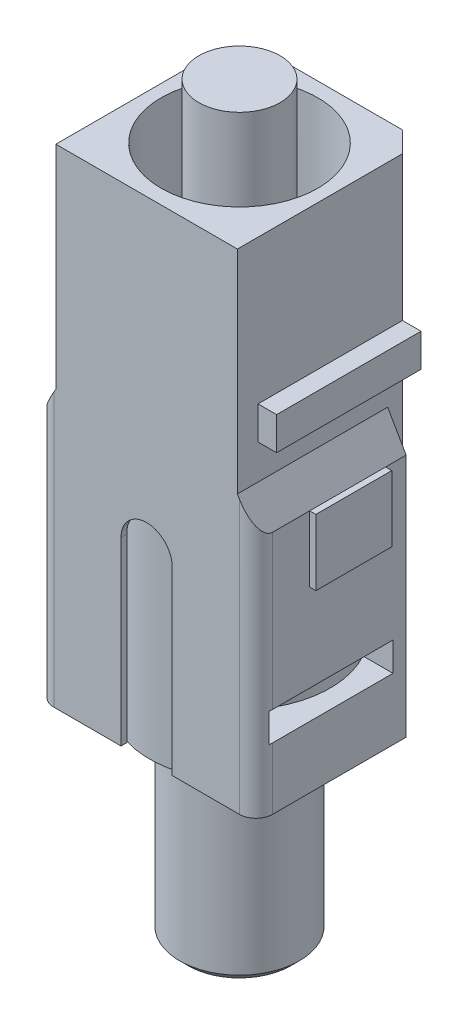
ISO-10303-21;
HEADER;
FILE_DESCRIPTION(('STEP AP214'),'2;1');
FILE_NAME('part.step','',(''),(''),'','','');
FILE_SCHEMA(('AUTOMOTIVE_DESIGN { 1 0 10303 214 1 1 1 1 }'));
ENDSEC;
DATA;
#1=APPLICATION_CONTEXT('core data for automotive mechanical design processes');
#2=APPLICATION_PROTOCOL_DEFINITION('international standard','automotive_design',2000,#1);
#3=PRODUCT_CONTEXT('',#1,'mechanical');
#4=PRODUCT('Part','Part','',(#3));
#5=PRODUCT_RELATED_PRODUCT_CATEGORY('part','',(#4));
#6=PRODUCT_DEFINITION_FORMATION('','',#4);
#7=PRODUCT_DEFINITION_CONTEXT('part definition',#1,'design');
#8=PRODUCT_DEFINITION('design','',#6,#7);
#9=PRODUCT_DEFINITION_SHAPE('','',#8);
#10=(LENGTH_UNIT() NAMED_UNIT(*) SI_UNIT(.MILLI.,.METRE.));
#11=(NAMED_UNIT(*) PLANE_ANGLE_UNIT() SI_UNIT($,.RADIAN.));
#12=(NAMED_UNIT(*) SI_UNIT($,.STERADIAN.) SOLID_ANGLE_UNIT());
#13=UNCERTAINTY_MEASURE_WITH_UNIT(LENGTH_MEASURE(1.E-05),#10,'distance_accuracy_value','');
#14=(GEOMETRIC_REPRESENTATION_CONTEXT(3) GLOBAL_UNCERTAINTY_ASSIGNED_CONTEXT((#13)) GLOBAL_UNIT_ASSIGNED_CONTEXT((#10,
#11,#12)) REPRESENTATION_CONTEXT('',''));
#15=CARTESIAN_POINT('',(0.,0.,0.));
#16=DIRECTION('',(0.,0.,1.));
#17=DIRECTION('',(1.,0.,0.));
#18=AXIS2_PLACEMENT_3D('',#15,#16,#17);
#19=CARTESIAN_POINT('',(-3.36550000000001,0.,-1.7653));
#20=DIRECTION('',(-1.,0.,0.));
#21=DIRECTION('',(0.,-1.,0.));
#22=AXIS2_PLACEMENT_3D('',#19,#20,#21);
#23=PLANE('',#22);
#24=DIRECTION('',(0.,0.,1.));
#25=VECTOR('',#24,1.);
#26=CARTESIAN_POINT('',(-3.36549999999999,-7.51839999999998,-1.7653));
#27=LINE('',#26,#25);
#28=CARTESIAN_POINT('',(-3.36549999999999,-7.51839999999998,-1.7653));
#29=VERTEX_POINT('',#28);
#30=CARTESIAN_POINT('',(-3.36549999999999,-7.51840000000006,2.34949999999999));
#31=VERTEX_POINT('',#30);
#32=EDGE_CURVE('E409',#29,#31,#27,.T.);
#33=ORIENTED_EDGE('',*,*,#32,.T.);
#34=DIRECTION('',(0.,-1.,0.));
#35=VECTOR('',#34,1.);
#36=CARTESIAN_POINT('',(-3.3655,7.51840000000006,2.3495));
#37=LINE('',#36,#35);
#38=CARTESIAN_POINT('',(-3.36549999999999,-5.61340000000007,2.34949999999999));
#39=VERTEX_POINT('',#38);
#40=EDGE_CURVE('E522',#31,#39,#37,.F.);
#41=ORIENTED_EDGE('',*,*,#40,.T.);
#42=DIRECTION('',(0.,0.,1.));
#43=VECTOR('',#42,1.);
#44=CARTESIAN_POINT('',(-3.3655,-5.61339999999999,-1.7653));
#45=LINE('',#44,#43);
#46=CARTESIAN_POINT('',(-3.36549999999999,-5.61339999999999,-1.35890000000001));
#47=VERTEX_POINT('',#46);
#48=EDGE_CURVE('E789',#47,#39,#45,.T.);
#49=ORIENTED_EDGE('',*,*,#48,.F.);
#50=DIRECTION('',(0.,-1.,0.));
#51=VECTOR('',#50,1.);
#52=CARTESIAN_POINT('',(-3.36549999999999,0.,-1.3589));
#53=LINE('',#52,#51);
#54=CARTESIAN_POINT('',(-3.36549999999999,-4.72440000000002,-1.35890000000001));
#55=VERTEX_POINT('',#54);
#56=EDGE_CURVE('E791',#55,#47,#53,.T.);
#57=ORIENTED_EDGE('',*,*,#56,.F.);
#58=DIRECTION('',(0.,0.,-1.));
#59=VECTOR('',#58,1.);
#60=CARTESIAN_POINT('',(-3.36549999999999,-4.72440000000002,-1.7653));
#61=LINE('',#60,#59);
#62=CARTESIAN_POINT('',(-3.36549999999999,-4.72440000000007,2.34949999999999));
#63=VERTEX_POINT('',#62);
#64=EDGE_CURVE('E787',#63,#55,#61,.T.);
#65=ORIENTED_EDGE('',*,*,#64,.F.);
#66=DIRECTION('',(0.,-1.,0.));
#67=VECTOR('',#66,1.);
#68=CARTESIAN_POINT('',(-3.3655,7.51840000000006,2.3495));
#69=LINE('',#68,#67);
#70=CARTESIAN_POINT('',(-3.36549999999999,0.,2.3495));
#71=VERTEX_POINT('',#70);
#72=EDGE_CURVE('E520',#63,#71,#69,.F.);
#73=ORIENTED_EDGE('',*,*,#72,.T.);
#74=DIRECTION('',(0.,0.,1.));
#75=VECTOR('',#74,1.);
#76=CARTESIAN_POINT('',(-3.36550000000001,0.,-1.7653));
#77=LINE('',#76,#75);
#78=CARTESIAN_POINT('',(-3.36549999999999,0.,1.2065));
#79=VERTEX_POINT('',#78);
#80=EDGE_CURVE('E360',#79,#71,#77,.T.);
#81=ORIENTED_EDGE('',*,*,#80,.F.);
#82=DIRECTION('',(0.,-1.,0.));
#83=VECTOR('',#82,1.);
#84=CARTESIAN_POINT('',(-3.36549999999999,-2.03200000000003,1.20649999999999));
#85=LINE('',#84,#83);
#86=CARTESIAN_POINT('',(-3.36549999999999,-2.03200000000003,1.20649999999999));
#87=VERTEX_POINT('',#86);
#88=EDGE_CURVE('E340',#79,#87,#85,.T.);
#89=ORIENTED_EDGE('',*,*,#88,.T.);
#90=DIRECTION('',(0.,0.,-1.));
#91=VECTOR('',#90,1.);
#92=CARTESIAN_POINT('',(-3.36550000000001,-2.03199999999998,-1.13030000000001));
#93=LINE('',#92,#91);
#94=CARTESIAN_POINT('',(-3.36550000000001,-2.03199999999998,-1.13030000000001));
#95=VERTEX_POINT('',#94);
#96=EDGE_CURVE('E352',#87,#95,#93,.T.);
#97=ORIENTED_EDGE('',*,*,#96,.T.);
#98=DIRECTION('',(0.,1.,0.));
#99=VECTOR('',#98,1.);
#100=CARTESIAN_POINT('',(-3.36550000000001,-2.03199999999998,-1.13030000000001));
#101=LINE('',#100,#99);
#102=CARTESIAN_POINT('',(-3.36550000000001,0.,-1.1303));
#103=VERTEX_POINT('',#102);
#104=EDGE_CURVE('E356',#95,#103,#101,.T.);
#105=ORIENTED_EDGE('',*,*,#104,.T.);
#106=CARTESIAN_POINT('',(-3.36550000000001,0.,-1.7653));
#107=VERTEX_POINT('',#106);
#108=EDGE_CURVE('E405',#107,#103,#77,.T.);
#109=ORIENTED_EDGE('',*,*,#108,.F.);
#110=DIRECTION('',(0.,-1.,0.));
#111=VECTOR('',#110,1.);
#112=CARTESIAN_POINT('',(-3.36550000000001,0.,-1.7653));
#113=LINE('',#112,#111);
#114=EDGE_CURVE('E464',#107,#29,#113,.T.);
#115=ORIENTED_EDGE('',*,*,#114,.T.);
#116=EDGE_LOOP('',(#33,#41,#49,#57,#65,#73,#81,#89,#97,#105,#109,#115));
#117=FACE_BOUND('',#116,.T.);
#118=ADVANCED_FACE('F24',(#117),#23,.T.);
#119=CARTESIAN_POINT('',(-2.79399999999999,3.07339999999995,2.2225));
#120=DIRECTION('',(0.,-1.,0.));
#121=DIRECTION('',(0.,0.,-1.));
#122=AXIS2_PLACEMENT_3D('',#119,#120,#121);
#123=PLANE('',#122);
#124=CARTESIAN_POINT('',(0.,3.0734,0.));
#125=DIRECTION('',(0.,-1.,0.));
#126=DIRECTION('',(0.,0.,-1.));
#127=AXIS2_PLACEMENT_3D('',#124,#125,#126);
#128=CIRCLE('',#127,2.413);
#129=CARTESIAN_POINT('',(0.,3.0734,-2.413));
#130=VERTEX_POINT('',#129);
#131=EDGE_CURVE('E762',#130,#130,#128,.F.);
#132=ORIENTED_EDGE('',*,*,#131,.T.);
#133=EDGE_LOOP('',(#132));
#134=FACE_BOUND('',#133,.T.);
#135=CARTESIAN_POINT('',(0.,3.0734,0.));
#136=DIRECTION('',(0.,-1.,0.));
#137=DIRECTION('',(0.,0.,-1.));
#138=AXIS2_PLACEMENT_3D('',#135,#136,#137);
#139=CIRCLE('',#138,1.25095);
#140=CARTESIAN_POINT('',(0.,3.0734,-1.25095));
#141=VERTEX_POINT('',#140);
#142=EDGE_CURVE('E431',#141,#141,#139,.F.);
#143=ORIENTED_EDGE('',*,*,#142,.F.);
#144=EDGE_LOOP('',(#143));
#145=FACE_BOUND('',#144,.T.);
#146=ADVANCED_FACE('F544',(#134,#145),#123,.F.);
#147=CARTESIAN_POINT('',(0.,-1.95580000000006,-2.85750000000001));
#148=DIRECTION('',(0.,0.,1.));
#149=DIRECTION('',(1.,0.,0.));
#150=AXIS2_PLACEMENT_3D('',#147,#148,#149);
#151=CYLINDRICAL_SURFACE('',#150,0.7874);
#152=CARTESIAN_POINT('',(0.787400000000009,-1.95580000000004,2.68075311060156));
#153=CARTESIAN_POINT('',(0.787399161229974,-1.99907542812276,2.6807537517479));
#154=CARTESIAN_POINT('',(0.783820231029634,-2.04235940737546,2.68181246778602));
#155=CARTESIAN_POINT('',(0.769630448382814,-2.12767052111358,2.68591843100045));
#156=CARTESIAN_POINT('',(0.759016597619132,-2.16969711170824,2.68896652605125));
#157=CARTESIAN_POINT('',(0.731139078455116,-2.25124668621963,2.69667921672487));
#158=CARTESIAN_POINT('',(0.713885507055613,-2.29077336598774,2.70134135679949));
#159=CARTESIAN_POINT('',(0.673250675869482,-2.36637894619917,2.71175361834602));
#160=CARTESIAN_POINT('',(0.649868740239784,-2.40245746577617,2.71750385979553));
#161=CARTESIAN_POINT('',(0.596942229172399,-2.47115012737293,2.72962444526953));
#162=CARTESIAN_POINT('',(0.567256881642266,-2.50365371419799,2.73600678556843));
#163=CARTESIAN_POINT('',(0.502868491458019,-2.56329330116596,2.74856937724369));
#164=CARTESIAN_POINT('',(0.468164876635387,-2.59042868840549,2.75474960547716));
#165=CARTESIAN_POINT('',(0.393949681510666,-2.63903099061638,2.76634655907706));
#166=CARTESIAN_POINT('',(0.354362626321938,-2.66038675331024,2.77174749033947));
#167=CARTESIAN_POINT('',(0.271981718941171,-2.69609656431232,2.78103890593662));
#168=CARTESIAN_POINT('',(0.229188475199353,-2.71045193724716,2.78492967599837));
#169=CARTESIAN_POINT('',(0.142765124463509,-2.73139211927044,2.79067753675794));
#170=CARTESIAN_POINT('',(0.0991839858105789,-2.73816528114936,2.79258383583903));
#171=CARTESIAN_POINT('',(0.0114650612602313,-2.74434268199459,2.79432056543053));
#172=CARTESIAN_POINT('',(-0.0326726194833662,-2.74374829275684,2.79415138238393));
#173=CARTESIAN_POINT('',(-0.11893615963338,-2.7353373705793,2.79179170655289));
#174=CARTESIAN_POINT('',(-0.161083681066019,-2.72772453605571,2.78965822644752));
#175=CARTESIAN_POINT('',(-0.243476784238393,-2.70582351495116,2.78367783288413));
#176=CARTESIAN_POINT('',(-0.283722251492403,-2.69153492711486,2.7798308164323));
#177=CARTESIAN_POINT('',(-0.361672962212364,-2.65654002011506,2.77077358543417));
#178=CARTESIAN_POINT('',(-0.399346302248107,-2.63576645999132,2.76554918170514));
#179=CARTESIAN_POINT('',(-0.470739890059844,-2.58844355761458,2.75429628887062));
#180=CARTESIAN_POINT('',(-0.504459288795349,-2.56189297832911,2.74826762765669));
#181=CARTESIAN_POINT('',(-0.568203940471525,-2.50269910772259,2.73581286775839));
#182=CARTESIAN_POINT('',(-0.598063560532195,-2.46987860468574,2.72938022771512));
#183=CARTESIAN_POINT('',(-0.651898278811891,-2.39963080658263,2.71702587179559));
#184=CARTESIAN_POINT('',(-0.675872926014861,-2.36220315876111,2.71110419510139));
#185=CARTESIAN_POINT('',(-0.717403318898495,-2.28341077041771,2.70041364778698));
#186=CARTESIAN_POINT('',(-0.734909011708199,-2.24201832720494,2.69565385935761));
#187=CARTESIAN_POINT('',(-0.762656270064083,-2.15670924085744,2.68793622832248));
#188=CARTESIAN_POINT('',(-0.772899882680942,-2.11279331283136,2.68497787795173));
#189=CARTESIAN_POINT('',(-0.785536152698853,-2.02524513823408,2.68130772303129));
#190=CARTESIAN_POINT('',(-0.788177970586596,-1.98165180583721,2.68052465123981));
#191=CARTESIAN_POINT('',(-0.786226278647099,-1.89464521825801,2.6810977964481));
#192=CARTESIAN_POINT('',(-0.781633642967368,-1.85123194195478,2.68245375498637));
#193=CARTESIAN_POINT('',(-0.765564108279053,-1.76681219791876,2.68708283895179));
#194=CARTESIAN_POINT('',(-0.754241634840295,-1.72577374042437,2.69031292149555));
#195=CARTESIAN_POINT('',(-0.725209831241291,-1.64617970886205,2.69828312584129));
#196=CARTESIAN_POINT('',(-0.707499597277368,-1.60762448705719,2.70302346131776));
#197=CARTESIAN_POINT('',(-0.665703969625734,-1.53306173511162,2.71362274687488));
#198=CARTESIAN_POINT('',(-0.641474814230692,-1.49713832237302,2.71950596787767));
#199=CARTESIAN_POINT('',(-0.587503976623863,-1.42977585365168,2.73167327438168));
#200=CARTESIAN_POINT('',(-0.55776113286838,-1.39833774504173,2.73795744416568));
#201=CARTESIAN_POINT('',(-0.492446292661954,-1.33977967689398,2.75046759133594));
#202=CARTESIAN_POINT('',(-0.456715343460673,-1.31283477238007,2.75668492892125));
#203=CARTESIAN_POINT('',(-0.381094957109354,-1.26532271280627,2.76815153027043));
#204=CARTESIAN_POINT('',(-0.341205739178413,-1.24475522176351,2.77340084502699));
#205=CARTESIAN_POINT('',(-0.258679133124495,-1.21077702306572,2.78230633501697));
#206=CARTESIAN_POINT('',(-0.216065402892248,-1.19731215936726,2.78597452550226));
#207=CARTESIAN_POINT('',(-0.129059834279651,-1.17777112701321,2.79135750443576));
#208=CARTESIAN_POINT('',(-0.0846684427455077,-1.17169311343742,2.79307278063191));
#209=CARTESIAN_POINT('',(0.00300503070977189,-1.16722496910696,2.79433067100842));
#210=CARTESIAN_POINT('',(0.0462732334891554,-1.16857941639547,2.79394547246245));
#211=CARTESIAN_POINT('',(0.131940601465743,-1.17833695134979,2.79121198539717));
#212=CARTESIAN_POINT('',(0.174339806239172,-1.18673971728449,2.78886378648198));
#213=CARTESIAN_POINT('',(0.256720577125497,-1.21020451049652,2.78248533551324));
#214=CARTESIAN_POINT('',(0.29671961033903,-1.22520940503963,2.77846953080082));
#215=CARTESIAN_POINT('',(0.373654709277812,-1.26140171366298,2.76917341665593));
#216=CARTESIAN_POINT('',(0.410590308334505,-1.2825900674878,2.7638929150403));
#217=CARTESIAN_POINT('',(0.481517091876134,-1.33126536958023,2.75243643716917));
#218=CARTESIAN_POINT('',(0.515391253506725,-1.35891772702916,2.74623886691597));
#219=CARTESIAN_POINT('',(0.578104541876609,-1.41942943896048,2.73372563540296));
#220=CARTESIAN_POINT('',(0.606942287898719,-1.45229021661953,2.72740994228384));
#221=CARTESIAN_POINT('',(0.6594929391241,-1.52328731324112,2.7151892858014));
#222=CARTESIAN_POINT('',(0.683057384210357,-1.56153625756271,2.70929879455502));
#223=CARTESIAN_POINT('',(0.723389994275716,-1.64161415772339,2.69881083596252));
#224=CARTESIAN_POINT('',(0.740162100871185,-1.68344102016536,2.6942126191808));
#225=CARTESIAN_POINT('',(0.764535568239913,-1.76348842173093,2.6873886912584));
#226=CARTESIAN_POINT('',(0.773088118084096,-1.80140119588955,2.68492192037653));
#227=CARTESIAN_POINT('',(0.784520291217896,-1.87814044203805,2.68160396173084));
#228=CARTESIAN_POINT('',(0.787400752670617,-1.91696677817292,2.68075253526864));
#229=CARTESIAN_POINT('',(0.787400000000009,-1.95580000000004,2.68075311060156));
#230=B_SPLINE_CURVE_WITH_KNOTS('',3,(#152,#153,#154,#155,#156,#157,#158,#159,#160,#161,#162,
#163,#164,#165,#166,#167,#168,#169,#170,#171,#172,#173,#174,#175,#176,#177,#178,#179,#180,#181,
#182,#183,#184,#185,#186,#187,#188,#189,#190,#191,#192,#193,#194,#195,#196,#197,#198,#199,#200,
#201,#202,#203,#204,#205,#206,#207,#208,#209,#210,#211,#212,#213,#214,#215,#216,#217,#218,#219,
#220,#221,#222,#223,#224,#225,#226,#227,#228,#229),.UNSPECIFIED.,.T.,.F.,(4,2,2,2,2,2,2,2,2,2,2,
2,2,2,2,2,2,2,2,2,2,2,2,2,2,2,2,2,2,2,2,2,2,2,2,2,2,2,4),(0.,0.129683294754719,
0.259421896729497,0.388963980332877,0.518520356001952,0.651349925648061,0.784194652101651,
0.919437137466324,1.05465402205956,1.18643175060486,1.31818494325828,1.4462306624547,
1.57428407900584,1.70371200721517,1.83316767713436,1.96704757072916,2.10093772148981,
2.23584315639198,2.37071054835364,2.50110411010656,2.631481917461,2.75897763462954,
2.88649139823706,3.01708763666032,3.14771141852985,3.28261141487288,3.41750430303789,
3.5513532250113,3.68516871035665,3.81441496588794,3.94365532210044,4.07179861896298,
4.19996140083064,4.33185530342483,4.4637853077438,4.59906001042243,4.73425609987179,
4.85064465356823,4.96701600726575),.UNSPECIFIED.);
#231=CARTESIAN_POINT('',(-0.787399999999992,-1.95580000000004,2.68075311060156));
#232=VERTEX_POINT('',#231);
#233=CARTESIAN_POINT('',(0.,-1.16840000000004,2.79399999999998));
#234=VERTEX_POINT('',#233);
#235=EDGE_CURVE('E724',#232,#234,#230,.T.);
#236=ORIENTED_EDGE('',*,*,#235,.T.);
#237=CARTESIAN_POINT('',(0.787400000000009,-1.95580000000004,2.68075311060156));
#238=VERTEX_POINT('',#237);
#239=EDGE_CURVE('E731',#234,#238,#230,.T.);
#240=ORIENTED_EDGE('',*,*,#239,.T.);
#241=DIRECTION('',(0.,0.,1.));
#242=VECTOR('',#241,1.);
#243=CARTESIAN_POINT('',(0.787399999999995,-1.95580000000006,-2.85750000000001));
#244=LINE('',#243,#242);
#245=CARTESIAN_POINT('',(0.787400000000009,-1.95580000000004,2.85749999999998));
#246=VERTEX_POINT('',#245);
#247=EDGE_CURVE('E815',#238,#246,#244,.T.);
#248=ORIENTED_EDGE('',*,*,#247,.T.);
#249=CARTESIAN_POINT('',(0.,-1.95580000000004,2.85749999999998));
#250=DIRECTION('',(0.,0.,1.));
#251=DIRECTION('',(1.,0.,0.));
#252=AXIS2_PLACEMENT_3D('',#249,#250,#251);
#253=CIRCLE('',#252,0.7874);
#254=CARTESIAN_POINT('',(-0.787399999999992,-1.95580000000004,2.85749999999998));
#255=VERTEX_POINT('',#254);
#256=EDGE_CURVE('E793',#246,#255,#253,.T.);
#257=ORIENTED_EDGE('',*,*,#256,.T.);
#258=DIRECTION('',(0.,0.,1.));
#259=VECTOR('',#258,1.);
#260=CARTESIAN_POINT('',(-0.787400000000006,-1.95580000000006,-2.85750000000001));
#261=LINE('',#260,#259);
#262=EDGE_CURVE('E811',#232,#255,#261,.T.);
#263=ORIENTED_EDGE('',*,*,#262,.F.);
#264=EDGE_LOOP('',(#236,#240,#248,#257,#263));
#265=FACE_BOUND('',#264,.T.);
#266=ADVANCED_FACE('F549',(#265),#151,.F.);
#267=CARTESIAN_POINT('',(0.787399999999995,-1.95580000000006,-2.85750000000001));
#268=DIRECTION('',(1.,0.,0.));
#269=DIRECTION('',(0.,1.,0.));
#270=AXIS2_PLACEMENT_3D('',#267,#268,#269);
#271=PLANE('',#270);
#272=ORIENTED_EDGE('',*,*,#247,.F.);
#273=DIRECTION('',(0.,-1.,0.));
#274=VECTOR('',#273,1.);
#275=CARTESIAN_POINT('',(0.787400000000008,-1.16840000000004,2.68075311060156));
#276=LINE('',#275,#274);
#277=CARTESIAN_POINT('',(0.787400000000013,-7.51840000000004,2.68075311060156));
#278=VERTEX_POINT('',#277);
#279=EDGE_CURVE('E732',#238,#278,#276,.T.);
#280=ORIENTED_EDGE('',*,*,#279,.T.);
#281=DIRECTION('',(0.,0.,1.));
#282=VECTOR('',#281,1.);
#283=CARTESIAN_POINT('',(0.787399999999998,-7.51840000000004,-2.85750000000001));
#284=LINE('',#283,#282);
#285=CARTESIAN_POINT('',(0.787400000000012,-7.51840000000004,2.85749999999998));
#286=VERTEX_POINT('',#285);
#287=EDGE_CURVE('E819',#278,#286,#284,.T.);
#288=ORIENTED_EDGE('',*,*,#287,.T.);
#289=DIRECTION('',(0.,1.,0.));
#290=VECTOR('',#289,1.);
#291=CARTESIAN_POINT('',(0.787400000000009,-1.95580000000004,2.85749999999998));
#292=LINE('',#291,#290);
#293=EDGE_CURVE('E799',#286,#246,#292,.T.);
#294=ORIENTED_EDGE('',*,*,#293,.T.);
#295=EDGE_LOOP('',(#272,#280,#288,#294));
#296=FACE_BOUND('',#295,.T.);
#297=ADVANCED_FACE('F631',(#296),#271,.F.);
#298=CARTESIAN_POINT('',(-0.787400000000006,-1.95580000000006,-2.85750000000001));
#299=DIRECTION('',(-1.,0.,0.));
#300=DIRECTION('',(0.,-1.,0.));
#301=AXIS2_PLACEMENT_3D('',#298,#299,#300);
#302=PLANE('',#301);
#303=CARTESIAN_POINT('',(-0.787400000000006,-1.95580000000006,-2.85750000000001));
#304=VERTEX_POINT('',#303);
#305=CARTESIAN_POINT('',(-0.787400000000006,-1.95580000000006,-2.68075311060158));
#306=VERTEX_POINT('',#305);
#307=EDGE_CURVE('E824',#304,#306,#261,.T.);
#308=ORIENTED_EDGE('',*,*,#307,.T.);
#309=DIRECTION('',(0.,-1.,0.));
#310=VECTOR('',#309,1.);
#311=CARTESIAN_POINT('',(-0.787400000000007,-1.16840000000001,-2.68075311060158));
#312=LINE('',#311,#310);
#313=CARTESIAN_POINT('',(-0.787400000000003,-7.51840000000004,-2.68075311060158));
#314=VERTEX_POINT('',#313);
#315=EDGE_CURVE('E755',#306,#314,#312,.T.);
#316=ORIENTED_EDGE('',*,*,#315,.T.);
#317=DIRECTION('',(0.,0.,1.));
#318=VECTOR('',#317,1.);
#319=CARTESIAN_POINT('',(-0.787400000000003,-7.51840000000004,-2.85750000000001));
#320=LINE('',#319,#318);
#321=CARTESIAN_POINT('',(-0.787400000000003,-7.51840000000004,-2.85750000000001));
#322=VERTEX_POINT('',#321);
#323=EDGE_CURVE('E820',#322,#314,#320,.T.);
#324=ORIENTED_EDGE('',*,*,#323,.F.);
#325=DIRECTION('',(0.,-1.,0.));
#326=VECTOR('',#325,1.);
#327=CARTESIAN_POINT('',(-0.787400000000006,-1.95580000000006,-2.85750000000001));
#328=LINE('',#327,#326);
#329=EDGE_CURVE('E805',#304,#322,#328,.T.);
#330=ORIENTED_EDGE('',*,*,#329,.F.);
#331=EDGE_LOOP('',(#308,#316,#324,#330));
#332=FACE_BOUND('',#331,.T.);
#333=ADVANCED_FACE('F626',(#332),#302,.F.);
#334=CARTESIAN_POINT('',(-2.794,-7.51840000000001,-2.85750000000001));
#335=DIRECTION('',(0.,-1.,0.));
#336=DIRECTION('',(0.,0.,-1.));
#337=AXIS2_PLACEMENT_3D('',#334,#335,#336);
#338=PLANE('',#337);
#339=DIRECTION('',(0.,0.,1.));
#340=VECTOR('',#339,1.);
#341=CARTESIAN_POINT('',(3.3655,-7.51840000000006,-1.7653));
#342=LINE('',#341,#340);
#343=CARTESIAN_POINT('',(3.3655,-7.51840000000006,-1.7653));
#344=VERTEX_POINT('',#343);
#345=CARTESIAN_POINT('',(3.36550000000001,-7.51840000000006,2.34949999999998));
#346=VERTEX_POINT('',#345);
#347=EDGE_CURVE('E450',#344,#346,#342,.T.);
#348=ORIENTED_EDGE('',*,*,#347,.T.);
#349=CARTESIAN_POINT('',(2.8575,-7.51840000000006,2.34949999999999));
#350=DIRECTION('',(0.,-1.,0.));
#351=DIRECTION('',(0.,0.,-1.));
#352=AXIS2_PLACEMENT_3D('',#349,#350,#351);
#353=CIRCLE('',#352,0.508);
#354=CARTESIAN_POINT('',(2.8575,-7.51840000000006,2.85749999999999));
#355=VERTEX_POINT('',#354);
#356=EDGE_CURVE('E517',#346,#355,#353,.T.);
#357=ORIENTED_EDGE('',*,*,#356,.T.);
#358=DIRECTION('',(1.,0.,0.));
#359=VECTOR('',#358,1.);
#360=CARTESIAN_POINT('',(-2.79399999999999,-7.51840000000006,2.85749999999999));
#361=LINE('',#360,#359);
#362=EDGE_CURVE('E1004',#286,#355,#361,.T.);
#363=ORIENTED_EDGE('',*,*,#362,.F.);
#364=ORIENTED_EDGE('',*,*,#287,.F.);
#365=CARTESIAN_POINT('',(0.,-7.51840000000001,0.));
#366=DIRECTION('',(0.,-1.,0.));
#367=DIRECTION('',(0.,0.,-1.));
#368=AXIS2_PLACEMENT_3D('',#365,#366,#367);
#369=CIRCLE('',#368,2.794);
#370=CARTESIAN_POINT('',(0.787399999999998,-7.51840000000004,-2.68075311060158));
#371=VERTEX_POINT('',#370);
#372=EDGE_CURVE('E694',#371,#278,#369,.T.);
#373=ORIENTED_EDGE('',*,*,#372,.F.);
#374=CARTESIAN_POINT('',(0.787399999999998,-7.51840000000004,-2.85750000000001));
#375=VERTEX_POINT('',#374);
#376=EDGE_CURVE('E816',#375,#371,#284,.T.);
#377=ORIENTED_EDGE('',*,*,#376,.F.);
#378=DIRECTION('',(-1.,0.,0.));
#379=VECTOR('',#378,1.);
#380=CARTESIAN_POINT('',(-2.794,-7.51840000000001,-2.85750000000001));
#381=LINE('',#380,#379);
#382=CARTESIAN_POINT('',(2.159,-7.51840000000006,-2.85750000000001));
#383=VERTEX_POINT('',#382);
#384=EDGE_CURVE('E927',#383,#375,#381,.T.);
#385=ORIENTED_EDGE('',*,*,#384,.F.);
#386=DIRECTION('',(-0.707106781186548,0.,-0.707106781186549));
#387=VECTOR('',#386,1.);
#388=CARTESIAN_POINT('',(-0.317499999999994,-7.51840000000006,-5.334));
#389=LINE('',#388,#387);
#390=CARTESIAN_POINT('',(2.79400000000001,-7.51840000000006,-2.22250000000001));
#391=VERTEX_POINT('',#390);
#392=EDGE_CURVE('E957',#383,#391,#389,.F.);
#393=ORIENTED_EDGE('',*,*,#392,.T.);
#394=DIRECTION('',(0.,0.,-1.));
#395=VECTOR('',#394,1.);
#396=CARTESIAN_POINT('',(2.79400000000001,-7.51840000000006,2.85749999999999));
#397=LINE('',#396,#395);
#398=CARTESIAN_POINT('',(2.79400000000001,-7.51840000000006,-1.7653));
#399=VERTEX_POINT('',#398);
#400=EDGE_CURVE('E937',#399,#391,#397,.T.);
#401=ORIENTED_EDGE('',*,*,#400,.F.);
#402=DIRECTION('',(1.,0.,0.));
#403=VECTOR('',#402,1.);
#404=CARTESIAN_POINT('',(2.79400000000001,-7.51840000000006,-1.7653));
#405=LINE('',#404,#403);
#406=EDGE_CURVE('E639',#399,#344,#405,.T.);
#407=ORIENTED_EDGE('',*,*,#406,.T.);
#408=EDGE_LOOP('',(#348,#357,#363,#364,#373,#377,#385,#393,#401,#407));
#409=FACE_BOUND('',#408,.T.);
#410=ADVANCED_FACE('F608',(#409),#338,.T.);
#411=CARTESIAN_POINT('',(-2.79400000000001,7.51840000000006,2.8575));
#412=DIRECTION('',(1.,0.,0.));
#413=DIRECTION('',(0.,0.,-1.));
#414=AXIS2_PLACEMENT_3D('',#411,#412,#413);
#415=PLANE('',#414);
#416=DIRECTION('',(0.,1.,0.));
#417=VECTOR('',#416,1.);
#418=CARTESIAN_POINT('',(-2.79400000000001,0.990600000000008,-1.7653));
#419=LINE('',#418,#417);
#420=CARTESIAN_POINT('',(-2.794,-7.51839999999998,-1.76530000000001));
#421=VERTEX_POINT('',#420);
#422=CARTESIAN_POINT('',(-2.79400000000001,0.990600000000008,-1.7653));
#423=VERTEX_POINT('',#422);
#424=EDGE_CURVE('E459',#421,#423,#419,.T.);
#425=ORIENTED_EDGE('',*,*,#424,.T.);
#426=DIRECTION('',(0.,0.,1.));
#427=VECTOR('',#426,1.);
#428=CARTESIAN_POINT('',(-2.79400000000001,0.990600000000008,-1.7653));
#429=LINE('',#428,#427);
#430=CARTESIAN_POINT('',(-2.79399999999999,0.990599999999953,2.8575));
#431=VERTEX_POINT('',#430);
#432=EDGE_CURVE('E414',#423,#431,#429,.T.);
#433=ORIENTED_EDGE('',*,*,#432,.T.);
#434=DIRECTION('',(0.,-1.,0.));
#435=VECTOR('',#434,1.);
#436=CARTESIAN_POINT('',(-2.79400000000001,7.51840000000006,2.8575));
#437=LINE('',#436,#435);
#438=CARTESIAN_POINT('',(-2.79400000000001,7.51840000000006,2.8575));
#439=VERTEX_POINT('',#438);
#440=EDGE_CURVE('E494',#439,#431,#437,.T.);
#441=ORIENTED_EDGE('',*,*,#440,.F.);
#442=DIRECTION('',(0.,0.,1.));
#443=VECTOR('',#442,1.);
#444=CARTESIAN_POINT('',(-2.79400000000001,7.51840000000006,2.8575));
#445=LINE('',#444,#443);
#446=CARTESIAN_POINT('',(-2.79400000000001,7.51840000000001,-2.2225));
#447=VERTEX_POINT('',#446);
#448=EDGE_CURVE('E933',#447,#439,#445,.T.);
#449=ORIENTED_EDGE('',*,*,#448,.F.);
#450=DIRECTION('',(0.,-1.,0.));
#451=VECTOR('',#450,1.);
#452=CARTESIAN_POINT('',(-2.79400000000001,7.51840000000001,-2.2225));
#453=LINE('',#452,#451);
#454=CARTESIAN_POINT('',(-2.79400000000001,3.07339999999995,-2.2225));
#455=VERTEX_POINT('',#454);
#456=EDGE_CURVE('E432',#447,#455,#453,.T.);
#457=ORIENTED_EDGE('',*,*,#456,.T.);
#458=DIRECTION('',(0.,0.,-1.));
#459=VECTOR('',#458,1.);
#460=CARTESIAN_POINT('',(-2.79400000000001,3.07339999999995,-2.2225));
#461=LINE('',#460,#459);
#462=CARTESIAN_POINT('',(-2.79399999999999,3.07339999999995,2.2225));
#463=VERTEX_POINT('',#462);
#464=EDGE_CURVE('E988',#463,#455,#461,.T.);
#465=ORIENTED_EDGE('',*,*,#464,.F.);
#466=DIRECTION('',(0.,-1.,0.));
#467=VECTOR('',#466,1.);
#468=CARTESIAN_POINT('',(-2.79399999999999,3.07339999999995,2.2225));
#469=LINE('',#468,#467);
#470=CARTESIAN_POINT('',(-2.79400000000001,2.05739999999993,2.2225));
#471=VERTEX_POINT('',#470);
#472=EDGE_CURVE('E994',#463,#471,#469,.T.);
#473=ORIENTED_EDGE('',*,*,#472,.T.);
#474=DIRECTION('',(0.,0.,-1.));
#475=VECTOR('',#474,1.);
#476=CARTESIAN_POINT('',(-2.79400000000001,2.05739999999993,-2.2225));
#477=LINE('',#476,#475);
#478=CARTESIAN_POINT('',(-2.79400000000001,2.05739999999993,-2.2225));
#479=VERTEX_POINT('',#478);
#480=EDGE_CURVE('E971',#471,#479,#477,.T.);
#481=ORIENTED_EDGE('',*,*,#480,.T.);
#482=CARTESIAN_POINT('',(-2.794,-7.51840000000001,-2.22250000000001));
#483=VERTEX_POINT('',#482);
#484=EDGE_CURVE('E1351',#479,#483,#453,.T.);
#485=ORIENTED_EDGE('',*,*,#484,.T.);
#486=DIRECTION('',(0.,0.,1.));
#487=VECTOR('',#486,1.);
#488=CARTESIAN_POINT('',(-2.79399999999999,-7.51840000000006,2.85749999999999));
#489=LINE('',#488,#487);
#490=EDGE_CURVE('E473',#483,#421,#489,.T.);
#491=ORIENTED_EDGE('',*,*,#490,.T.);
#492=EDGE_LOOP('',(#425,#433,#441,#449,#457,#465,#473,#481,#485,#491));
#493=FACE_BOUND('',#492,.T.);
#494=ADVANCED_FACE('F26',(#493),#415,.F.);
#495=CARTESIAN_POINT('',(-2.79400000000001,7.51840000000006,2.8575));
#496=DIRECTION('',(0.,0.,-1.));
#497=DIRECTION('',(-1.,0.,0.));
#498=AXIS2_PLACEMENT_3D('',#495,#496,#497);
#499=PLANE('',#498);
#500=ORIENTED_EDGE('',*,*,#362,.T.);
#501=DIRECTION('',(0.,1.,0.));
#502=VECTOR('',#501,1.);
#503=CARTESIAN_POINT('',(2.8575,7.51840000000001,2.8575));
#504=LINE('',#503,#502);
#505=CARTESIAN_POINT('',(2.8575,0.880533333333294,2.8575));
#506=VERTEX_POINT('',#505);
#507=EDGE_CURVE('E500',#355,#506,#504,.T.);
#508=ORIENTED_EDGE('',*,*,#507,.T.);
#509=DIRECTION('',(-0.499722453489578,0.8661855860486,0.));
#510=VECTOR('',#509,1.);
#511=CARTESIAN_POINT('',(2.794,0.99059999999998,2.8575));
#512=LINE('',#511,#510);
#513=CARTESIAN_POINT('',(2.794,0.99059999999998,2.8575));
#514=VERTEX_POINT('',#513);
#515=EDGE_CURVE('E653',#506,#514,#512,.T.);
#516=ORIENTED_EDGE('',*,*,#515,.T.);
#517=DIRECTION('',(0.,-1.,0.));
#518=VECTOR('',#517,1.);
#519=CARTESIAN_POINT('',(2.794,7.51840000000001,2.8575));
#520=LINE('',#519,#518);
#521=CARTESIAN_POINT('',(2.794,7.51840000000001,2.8575));
#522=VERTEX_POINT('',#521);
#523=EDGE_CURVE('E948',#522,#514,#520,.T.);
#524=ORIENTED_EDGE('',*,*,#523,.F.);
#525=DIRECTION('',(1.,0.,0.));
#526=VECTOR('',#525,1.);
#527=CARTESIAN_POINT('',(-2.79400000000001,7.51840000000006,2.8575));
#528=LINE('',#527,#526);
#529=EDGE_CURVE('E935',#439,#522,#528,.T.);
#530=ORIENTED_EDGE('',*,*,#529,.F.);
#531=ORIENTED_EDGE('',*,*,#440,.T.);
#532=DIRECTION('',(-0.499722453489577,-0.8661855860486,0.));
#533=VECTOR('',#532,1.);
#534=CARTESIAN_POINT('',(-2.79399999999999,0.990599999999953,2.8575));
#535=LINE('',#534,#533);
#536=CARTESIAN_POINT('',(-2.8575,0.880533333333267,2.8575));
#537=VERTEX_POINT('',#536);
#538=EDGE_CURVE('E442',#431,#537,#535,.T.);
#539=ORIENTED_EDGE('',*,*,#538,.T.);
#540=DIRECTION('',(0.,-1.,0.));
#541=VECTOR('',#540,1.);
#542=CARTESIAN_POINT('',(-2.8575,7.51840000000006,2.8575));
#543=LINE('',#542,#541);
#544=CARTESIAN_POINT('',(-2.85749999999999,-7.51840000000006,2.85749999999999));
#545=VERTEX_POINT('',#544);
#546=EDGE_CURVE('E381',#537,#545,#543,.T.);
#547=ORIENTED_EDGE('',*,*,#546,.T.);
#548=CARTESIAN_POINT('',(-0.787399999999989,-7.51840000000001,2.85749999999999));
#549=VERTEX_POINT('',#548);
#550=EDGE_CURVE('E1005',#545,#549,#361,.T.);
#551=ORIENTED_EDGE('',*,*,#550,.T.);
#552=DIRECTION('',(0.,-1.,0.));
#553=VECTOR('',#552,1.);
#554=CARTESIAN_POINT('',(-0.787399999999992,-1.95580000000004,2.85749999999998));
#555=LINE('',#554,#553);
#556=EDGE_CURVE('E796',#255,#549,#555,.T.);
#557=ORIENTED_EDGE('',*,*,#556,.F.);
#558=ORIENTED_EDGE('',*,*,#256,.F.);
#559=ORIENTED_EDGE('',*,*,#293,.F.);
#560=EDGE_LOOP('',(#500,#508,#516,#524,#530,#531,#539,#547,#551,#557,#558,#559));
#561=FACE_BOUND('',#560,.T.);
#562=ADVANCED_FACE('F492',(#561),#499,.F.);
#563=CARTESIAN_POINT('',(2.794,7.51840000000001,2.8575));
#564=DIRECTION('',(-1.,0.,0.));
#565=DIRECTION('',(0.,0.,1.));
#566=AXIS2_PLACEMENT_3D('',#563,#564,#565);
#567=PLANE('',#566);
#568=ORIENTED_EDGE('',*,*,#523,.T.);
#569=DIRECTION('',(0.,0.,1.));
#570=VECTOR('',#569,1.);
#571=CARTESIAN_POINT('',(2.794,0.990599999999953,-1.7653));
#572=LINE('',#571,#570);
#573=CARTESIAN_POINT('',(2.794,0.990599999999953,-1.7653));
#574=VERTEX_POINT('',#573);
#575=EDGE_CURVE('E454',#574,#514,#572,.T.);
#576=ORIENTED_EDGE('',*,*,#575,.F.);
#577=DIRECTION('',(0.,-1.,0.));
#578=VECTOR('',#577,1.);
#579=CARTESIAN_POINT('',(2.794,0.990599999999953,-1.7653));
#580=LINE('',#579,#578);
#581=EDGE_CURVE('E831',#574,#399,#580,.T.);
#582=ORIENTED_EDGE('',*,*,#581,.T.);
#583=ORIENTED_EDGE('',*,*,#400,.T.);
#584=DIRECTION('',(0.,1.,0.));
#585=VECTOR('',#584,1.);
#586=CARTESIAN_POINT('',(2.79399999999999,7.51839999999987,-2.22249999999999));
#587=LINE('',#586,#585);
#588=CARTESIAN_POINT('',(2.79399999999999,2.05739999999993,-2.2225));
#589=VERTEX_POINT('',#588);
#590=EDGE_CURVE('E968',#391,#589,#587,.T.);
#591=ORIENTED_EDGE('',*,*,#590,.T.);
#592=DIRECTION('',(0.,0.,1.));
#593=VECTOR('',#592,1.);
#594=CARTESIAN_POINT('',(2.794,2.05739999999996,2.2225));
#595=LINE('',#594,#593);
#596=CARTESIAN_POINT('',(2.794,2.05739999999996,2.2225));
#597=VERTEX_POINT('',#596);
#598=EDGE_CURVE('E423',#589,#597,#595,.T.);
#599=ORIENTED_EDGE('',*,*,#598,.T.);
#600=DIRECTION('',(0.,-1.,0.));
#601=VECTOR('',#600,1.);
#602=CARTESIAN_POINT('',(2.794,3.07339999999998,2.2225));
#603=LINE('',#602,#601);
#604=CARTESIAN_POINT('',(2.794,3.07339999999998,2.2225));
#605=VERTEX_POINT('',#604);
#606=EDGE_CURVE('E976',#605,#597,#603,.T.);
#607=ORIENTED_EDGE('',*,*,#606,.F.);
#608=DIRECTION('',(0.,0.,1.));
#609=VECTOR('',#608,1.);
#610=CARTESIAN_POINT('',(2.794,3.07339999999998,2.2225));
#611=LINE('',#610,#609);
#612=CARTESIAN_POINT('',(2.79399999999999,3.07339999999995,-2.2225));
#613=VERTEX_POINT('',#612);
#614=EDGE_CURVE('E1402',#613,#605,#611,.T.);
#615=ORIENTED_EDGE('',*,*,#614,.F.);
#616=CARTESIAN_POINT('',(2.79399999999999,7.51839999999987,-2.22249999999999));
#617=VERTEX_POINT('',#616);
#618=EDGE_CURVE('E959',#613,#617,#587,.T.);
#619=ORIENTED_EDGE('',*,*,#618,.T.);
#620=DIRECTION('',(0.,0.,-1.));
#621=VECTOR('',#620,1.);
#622=CARTESIAN_POINT('',(2.794,7.51840000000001,2.8575));
#623=LINE('',#622,#621);
#624=EDGE_CURVE('E942',#522,#617,#623,.T.);
#625=ORIENTED_EDGE('',*,*,#624,.F.);
#626=EDGE_LOOP('',(#568,#576,#582,#583,#591,#599,#607,#615,#619,#625));
#627=FACE_BOUND('',#626,.T.);
#628=ADVANCED_FACE('F615',(#627),#567,.F.);
#629=CARTESIAN_POINT('',(-2.79400000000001,7.51839999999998,-2.8575));
#630=DIRECTION('',(0.,0.,1.));
#631=DIRECTION('',(1.,0.,0.));
#632=AXIS2_PLACEMENT_3D('',#629,#630,#631);
#633=PLANE('',#632);
#634=ORIENTED_EDGE('',*,*,#384,.T.);
#635=DIRECTION('',(0.,1.,0.));
#636=VECTOR('',#635,1.);
#637=CARTESIAN_POINT('',(0.787399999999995,-1.95580000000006,-2.85750000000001));
#638=LINE('',#637,#636);
#639=CARTESIAN_POINT('',(0.787399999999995,-1.95580000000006,-2.85750000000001));
#640=VERTEX_POINT('',#639);
#641=EDGE_CURVE('E808',#375,#640,#638,.T.);
#642=ORIENTED_EDGE('',*,*,#641,.T.);
#643=CARTESIAN_POINT('',(0.,-1.95580000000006,-2.85750000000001));
#644=DIRECTION('',(0.,0.,1.));
#645=DIRECTION('',(1.,0.,0.));
#646=AXIS2_PLACEMENT_3D('',#643,#644,#645);
#647=CIRCLE('',#646,0.7874);
#648=EDGE_CURVE('E802',#640,#304,#647,.T.);
#649=ORIENTED_EDGE('',*,*,#648,.T.);
#650=ORIENTED_EDGE('',*,*,#329,.T.);
#651=CARTESIAN_POINT('',(-2.15899999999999,-7.51840000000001,-2.85750000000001));
#652=VERTEX_POINT('',#651);
#653=EDGE_CURVE('E916',#322,#652,#381,.T.);
#654=ORIENTED_EDGE('',*,*,#653,.T.);
#655=DIRECTION('',(0.,1.,0.));
#656=VECTOR('',#655,1.);
#657=CARTESIAN_POINT('',(-2.15900000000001,7.51839999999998,-2.8575));
#658=LINE('',#657,#656);
#659=CARTESIAN_POINT('',(-2.15900000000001,7.51839999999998,-2.8575));
#660=VERTEX_POINT('',#659);
#661=EDGE_CURVE('E952',#652,#660,#658,.T.);
#662=ORIENTED_EDGE('',*,*,#661,.T.);
#663=DIRECTION('',(-1.,0.,0.));
#664=VECTOR('',#663,1.);
#665=CARTESIAN_POINT('',(-2.79400000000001,7.51839999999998,-2.8575));
#666=LINE('',#665,#664);
#667=CARTESIAN_POINT('',(2.15899999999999,7.51839999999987,-2.85749999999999));
#668=VERTEX_POINT('',#667);
#669=EDGE_CURVE('E945',#668,#660,#666,.T.);
#670=ORIENTED_EDGE('',*,*,#669,.F.);
#671=DIRECTION('',(0.,-1.,0.));
#672=VECTOR('',#671,1.);
#673=CARTESIAN_POINT('',(2.15899999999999,7.51839999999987,-2.85749999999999));
#674=LINE('',#673,#672);
#675=EDGE_CURVE('E932',#668,#383,#674,.T.);
#676=ORIENTED_EDGE('',*,*,#675,.T.);
#677=EDGE_LOOP('',(#634,#642,#649,#650,#654,#662,#670,#676));
#678=FACE_BOUND('',#677,.T.);
#679=ADVANCED_FACE('F611',(#678),#633,.F.);
#680=CARTESIAN_POINT('',(-2.79400000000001,7.51839999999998,-2.8575));
#681=DIRECTION('',(0.,-1.,0.));
#682=DIRECTION('',(0.,0.,-1.));
#683=AXIS2_PLACEMENT_3D('',#680,#681,#682);
#684=PLANE('',#683);
#685=CARTESIAN_POINT('',(0.,7.51840000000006,0.));
#686=DIRECTION('',(0.,1.,0.));
#687=DIRECTION('',(0.,0.,1.));
#688=AXIS2_PLACEMENT_3D('',#685,#686,#687);
#689=CIRCLE('',#688,2.413);
#690=CARTESIAN_POINT('',(0.,7.51840000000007,2.413));
#691=VERTEX_POINT('',#690);
#692=EDGE_CURVE('E759',#691,#691,#689,.T.);
#693=ORIENTED_EDGE('',*,*,#692,.F.);
#694=EDGE_LOOP('',(#693));
#695=FACE_BOUND('',#694,.T.);
#696=ORIENTED_EDGE('',*,*,#624,.T.);
#697=DIRECTION('',(0.707106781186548,0.,0.707106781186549));
#698=VECTOR('',#697,1.);
#699=CARTESIAN_POINT('',(2.15899999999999,7.51839999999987,-2.85749999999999));
#700=LINE('',#699,#698);
#701=EDGE_CURVE('E1347',#617,#668,#700,.F.);
#702=ORIENTED_EDGE('',*,*,#701,.T.);
#703=ORIENTED_EDGE('',*,*,#669,.T.);
#704=DIRECTION('',(0.707106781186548,0.,-0.707106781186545));
#705=VECTOR('',#704,1.);
#706=CARTESIAN_POINT('',(-2.79400000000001,7.51840000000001,-2.2225));
#707=LINE('',#706,#705);
#708=EDGE_CURVE('E962',#660,#447,#707,.F.);
#709=ORIENTED_EDGE('',*,*,#708,.T.);
#710=ORIENTED_EDGE('',*,*,#448,.T.);
#711=ORIENTED_EDGE('',*,*,#529,.T.);
#712=EDGE_LOOP('',(#696,#702,#703,#709,#710,#711));
#713=FACE_BOUND('',#712,.T.);
#714=ADVANCED_FACE('F607',(#695,#713),#684,.F.);
#715=ORIENTED_EDGE('',*,*,#550,.F.);
#716=CARTESIAN_POINT('',(-2.85749999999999,-7.51840000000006,2.34949999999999));
#717=DIRECTION('',(0.,-1.,0.));
#718=DIRECTION('',(0.,0.,-1.));
#719=AXIS2_PLACEMENT_3D('',#716,#717,#718);
#720=CIRCLE('',#719,0.508);
#721=EDGE_CURVE('E499',#545,#31,#720,.T.);
#722=ORIENTED_EDGE('',*,*,#721,.T.);
#723=ORIENTED_EDGE('',*,*,#32,.F.);
#724=DIRECTION('',(1.,0.,0.));
#725=VECTOR('',#724,1.);
#726=CARTESIAN_POINT('',(-3.36549999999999,-7.51839999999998,-1.7653));
#727=LINE('',#726,#725);
#728=EDGE_CURVE('E417',#29,#421,#727,.T.);
#729=ORIENTED_EDGE('',*,*,#728,.T.);
#730=ORIENTED_EDGE('',*,*,#490,.F.);
#731=DIRECTION('',(-0.707106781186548,0.,0.707106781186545));
#732=VECTOR('',#731,1.);
#733=CARTESIAN_POINT('',(-2.4765,-7.51840000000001,-2.54000000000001));
#734=LINE('',#733,#732);
#735=EDGE_CURVE('E955',#483,#652,#734,.F.);
#736=ORIENTED_EDGE('',*,*,#735,.T.);
#737=ORIENTED_EDGE('',*,*,#653,.F.);
#738=ORIENTED_EDGE('',*,*,#323,.T.);
#739=CARTESIAN_POINT('',(-0.787399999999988,-7.51840000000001,2.68075311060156));
#740=VERTEX_POINT('',#739);
#741=EDGE_CURVE('E693',#740,#314,#369,.T.);
#742=ORIENTED_EDGE('',*,*,#741,.F.);
#743=EDGE_CURVE('E823',#740,#549,#320,.T.);
#744=ORIENTED_EDGE('',*,*,#743,.T.);
#745=EDGE_LOOP('',(#715,#722,#723,#729,#730,#736,#737,#738,#742,#744));
#746=FACE_BOUND('',#745,.T.);
#747=ADVANCED_FACE('F471',(#746),#338,.T.);
#748=CARTESIAN_POINT('',(2.15899999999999,7.51839999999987,-2.85749999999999));
#749=DIRECTION('',(-0.707106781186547,0.,0.707106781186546));
#750=DIRECTION('',(0.707106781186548,0.,0.707106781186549));
#751=AXIS2_PLACEMENT_3D('',#748,#749,#750);
#752=PLANE('',#751);
#753=ORIENTED_EDGE('',*,*,#701,.F.);
#754=ORIENTED_EDGE('',*,*,#618,.F.);
#755=DIRECTION('',(0.,-1.,0.));
#756=VECTOR('',#755,1.);
#757=CARTESIAN_POINT('',(2.79399999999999,3.07339999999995,-2.2225));
#758=LINE('',#757,#756);
#759=EDGE_CURVE('E1387',#613,#589,#758,.T.);
#760=ORIENTED_EDGE('',*,*,#759,.T.);
#761=ORIENTED_EDGE('',*,*,#590,.F.);
#762=ORIENTED_EDGE('',*,*,#392,.F.);
#763=ORIENTED_EDGE('',*,*,#675,.F.);
#764=EDGE_LOOP('',(#753,#754,#760,#761,#762,#763));
#765=FACE_BOUND('',#764,.T.);
#766=ADVANCED_FACE('F600',(#765),#752,.F.);
#767=CARTESIAN_POINT('',(-2.79400000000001,7.51840000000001,-2.2225));
#768=DIRECTION('',(0.707106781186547,0.,0.70710678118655));
#769=DIRECTION('',(0.707106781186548,0.,-0.707106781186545));
#770=AXIS2_PLACEMENT_3D('',#767,#768,#769);
#771=PLANE('',#770);
#772=ORIENTED_EDGE('',*,*,#708,.F.);
#773=ORIENTED_EDGE('',*,*,#661,.F.);
#774=ORIENTED_EDGE('',*,*,#735,.F.);
#775=ORIENTED_EDGE('',*,*,#484,.F.);
#776=DIRECTION('',(0.,-1.,0.));
#777=VECTOR('',#776,1.);
#778=CARTESIAN_POINT('',(-2.79400000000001,3.07339999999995,-2.2225));
#779=LINE('',#778,#777);
#780=EDGE_CURVE('E1003',#455,#479,#779,.T.);
#781=ORIENTED_EDGE('',*,*,#780,.F.);
#782=ORIENTED_EDGE('',*,*,#456,.F.);
#783=EDGE_LOOP('',(#772,#773,#774,#775,#781,#782));
#784=FACE_BOUND('',#783,.T.);
#785=ADVANCED_FACE('F596',(#784),#771,.F.);
#786=CARTESIAN_POINT('',(-2.79400000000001,3.07339999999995,-2.2225));
#787=DIRECTION('',(0.,0.,1.));
#788=DIRECTION('',(1.,0.,0.));
#789=AXIS2_PLACEMENT_3D('',#786,#787,#788);
#790=PLANE('',#789);
#791=DIRECTION('',(-1.,0.,0.));
#792=VECTOR('',#791,1.);
#793=CARTESIAN_POINT('',(-2.79400000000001,2.05739999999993,-2.2225));
#794=LINE('',#793,#792);
#795=CARTESIAN_POINT('',(-3.36550000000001,2.05739999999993,-2.2225));
#796=VERTEX_POINT('',#795);
#797=EDGE_CURVE('E975',#479,#796,#794,.T.);
#798=ORIENTED_EDGE('',*,*,#797,.T.);
#799=DIRECTION('',(0.,-1.,0.));
#800=VECTOR('',#799,1.);
#801=CARTESIAN_POINT('',(-3.36550000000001,3.07339999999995,-2.2225));
#802=LINE('',#801,#800);
#803=CARTESIAN_POINT('',(-3.36550000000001,3.07339999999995,-2.2225));
#804=VERTEX_POINT('',#803);
#805=EDGE_CURVE('E1000',#804,#796,#802,.T.);
#806=ORIENTED_EDGE('',*,*,#805,.F.);
#807=DIRECTION('',(-1.,0.,0.));
#808=VECTOR('',#807,1.);
#809=CARTESIAN_POINT('',(-2.79400000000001,3.07339999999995,-2.2225));
#810=LINE('',#809,#808);
#811=EDGE_CURVE('E992',#455,#804,#810,.T.);
#812=ORIENTED_EDGE('',*,*,#811,.F.);
#813=ORIENTED_EDGE('',*,*,#780,.T.);
#814=EDGE_LOOP('',(#798,#806,#812,#813));
#815=FACE_BOUND('',#814,.T.);
#816=ADVANCED_FACE('F592',(#815),#790,.F.);
#817=CARTESIAN_POINT('',(-3.36550000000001,3.07339999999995,-2.2225));
#818=DIRECTION('',(1.,0.,0.));
#819=DIRECTION('',(0.,0.,-1.));
#820=AXIS2_PLACEMENT_3D('',#817,#818,#819);
#821=PLANE('',#820);
#822=DIRECTION('',(0.,0.,1.));
#823=VECTOR('',#822,1.);
#824=CARTESIAN_POINT('',(-3.36550000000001,2.05739999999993,-2.2225));
#825=LINE('',#824,#823);
#826=CARTESIAN_POINT('',(-3.36549999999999,2.05739999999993,2.2225));
#827=VERTEX_POINT('',#826);
#828=EDGE_CURVE('E983',#796,#827,#825,.T.);
#829=ORIENTED_EDGE('',*,*,#828,.T.);
#830=DIRECTION('',(0.,-1.,0.));
#831=VECTOR('',#830,1.);
#832=CARTESIAN_POINT('',(-3.3655,3.07339999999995,2.2225));
#833=LINE('',#832,#831);
#834=CARTESIAN_POINT('',(-3.3655,3.07339999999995,2.2225));
#835=VERTEX_POINT('',#834);
#836=EDGE_CURVE('E997',#835,#827,#833,.T.);
#837=ORIENTED_EDGE('',*,*,#836,.F.);
#838=DIRECTION('',(0.,0.,1.));
#839=VECTOR('',#838,1.);
#840=CARTESIAN_POINT('',(-3.36550000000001,3.07339999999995,-2.2225));
#841=LINE('',#840,#839);
#842=EDGE_CURVE('E989',#804,#835,#841,.T.);
#843=ORIENTED_EDGE('',*,*,#842,.F.);
#844=ORIENTED_EDGE('',*,*,#805,.T.);
#845=EDGE_LOOP('',(#829,#837,#843,#844));
#846=FACE_BOUND('',#845,.T.);
#847=ADVANCED_FACE('F588',(#846),#821,.F.);
#848=CARTESIAN_POINT('',(-2.79399999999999,3.07339999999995,2.2225));
#849=DIRECTION('',(0.,0.,-1.));
#850=DIRECTION('',(-1.,0.,0.));
#851=AXIS2_PLACEMENT_3D('',#848,#849,#850);
#852=PLANE('',#851);
#853=DIRECTION('',(1.,0.,0.));
#854=VECTOR('',#853,1.);
#855=CARTESIAN_POINT('',(-2.79400000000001,2.05739999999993,2.2225));
#856=LINE('',#855,#854);
#857=EDGE_CURVE('E985',#827,#471,#856,.T.);
#858=ORIENTED_EDGE('',*,*,#857,.T.);
#859=ORIENTED_EDGE('',*,*,#472,.F.);
#860=DIRECTION('',(1.,0.,0.));
#861=VECTOR('',#860,1.);
#862=CARTESIAN_POINT('',(-2.79399999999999,3.07339999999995,2.2225));
#863=LINE('',#862,#861);
#864=EDGE_CURVE('E991',#835,#463,#863,.T.);
#865=ORIENTED_EDGE('',*,*,#864,.F.);
#866=ORIENTED_EDGE('',*,*,#836,.T.);
#867=EDGE_LOOP('',(#858,#859,#865,#866));
#868=FACE_BOUND('',#867,.T.);
#869=ADVANCED_FACE('F584',(#868),#852,.F.);
#870=CARTESIAN_POINT('',(-2.79399999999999,3.07339999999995,2.2225));
#871=DIRECTION('',(0.,-1.,0.));
#872=DIRECTION('',(0.,0.,-1.));
#873=AXIS2_PLACEMENT_3D('',#870,#871,#872);
#874=PLANE('',#873);
#875=ORIENTED_EDGE('',*,*,#464,.T.);
#876=ORIENTED_EDGE('',*,*,#811,.T.);
#877=ORIENTED_EDGE('',*,*,#842,.T.);
#878=ORIENTED_EDGE('',*,*,#864,.T.);
#879=EDGE_LOOP('',(#875,#876,#877,#878));
#880=FACE_BOUND('',#879,.T.);
#881=ADVANCED_FACE('F580',(#880),#874,.F.);
#882=CARTESIAN_POINT('',(-2.79400000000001,2.05739999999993,2.2225));
#883=DIRECTION('',(0.,-1.,0.));
#884=DIRECTION('',(0.,0.,-1.));
#885=AXIS2_PLACEMENT_3D('',#882,#883,#884);
#886=PLANE('',#885);
#887=ORIENTED_EDGE('',*,*,#480,.F.);
#888=ORIENTED_EDGE('',*,*,#857,.F.);
#889=ORIENTED_EDGE('',*,*,#828,.F.);
#890=ORIENTED_EDGE('',*,*,#797,.F.);
#891=EDGE_LOOP('',(#887,#888,#889,#890));
#892=FACE_BOUND('',#891,.T.);
#893=ADVANCED_FACE('F576',(#892),#886,.T.);
#894=CARTESIAN_POINT('',(2.794,3.07339999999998,2.2225));
#895=DIRECTION('',(0.,0.,-1.));
#896=DIRECTION('',(-1.,0.,0.));
#897=AXIS2_PLACEMENT_3D('',#894,#895,#896);
#898=PLANE('',#897);
#899=DIRECTION('',(1.,0.,0.));
#900=VECTOR('',#899,1.);
#901=CARTESIAN_POINT('',(2.794,2.05739999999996,2.2225));
#902=LINE('',#901,#900);
#903=CARTESIAN_POINT('',(3.36550000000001,2.05739999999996,2.2225));
#904=VERTEX_POINT('',#903);
#905=EDGE_CURVE('E420',#597,#904,#902,.T.);
#906=ORIENTED_EDGE('',*,*,#905,.T.);
#907=DIRECTION('',(0.,-1.,0.));
#908=VECTOR('',#907,1.);
#909=CARTESIAN_POINT('',(3.36550000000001,3.07339999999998,2.2225));
#910=LINE('',#909,#908);
#911=CARTESIAN_POINT('',(3.36550000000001,3.07339999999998,2.2225));
#912=VERTEX_POINT('',#911);
#913=EDGE_CURVE('E1393',#912,#904,#910,.T.);
#914=ORIENTED_EDGE('',*,*,#913,.F.);
#915=DIRECTION('',(1.,0.,0.));
#916=VECTOR('',#915,1.);
#917=CARTESIAN_POINT('',(2.794,3.07339999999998,2.2225));
#918=LINE('',#917,#916);
#919=EDGE_CURVE('E1407',#605,#912,#918,.T.);
#920=ORIENTED_EDGE('',*,*,#919,.F.);
#921=ORIENTED_EDGE('',*,*,#606,.T.);
#922=EDGE_LOOP('',(#906,#914,#920,#921));
#923=FACE_BOUND('',#922,.T.);
#924=ADVANCED_FACE('F572',(#923),#898,.F.);
#925=CARTESIAN_POINT('',(3.36550000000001,3.07339999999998,2.2225));
#926=DIRECTION('',(-1.,0.,0.));
#927=DIRECTION('',(0.,0.,1.));
#928=AXIS2_PLACEMENT_3D('',#925,#926,#927);
#929=PLANE('',#928);
#930=DIRECTION('',(0.,0.,-1.));
#931=VECTOR('',#930,1.);
#932=CARTESIAN_POINT('',(3.36550000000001,2.05739999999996,2.2225));
#933=LINE('',#932,#931);
#934=CARTESIAN_POINT('',(3.36549999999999,2.05739999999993,-2.2225));
#935=VERTEX_POINT('',#934);
#936=EDGE_CURVE('E1403',#904,#935,#933,.T.);
#937=ORIENTED_EDGE('',*,*,#936,.T.);
#938=DIRECTION('',(0.,-1.,0.));
#939=VECTOR('',#938,1.);
#940=CARTESIAN_POINT('',(3.36549999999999,3.07339999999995,-2.2225));
#941=LINE('',#940,#939);
#942=CARTESIAN_POINT('',(3.36549999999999,3.07339999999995,-2.2225));
#943=VERTEX_POINT('',#942);
#944=EDGE_CURVE('E1389',#943,#935,#941,.T.);
#945=ORIENTED_EDGE('',*,*,#944,.F.);
#946=DIRECTION('',(0.,0.,-1.));
#947=VECTOR('',#946,1.);
#948=CARTESIAN_POINT('',(3.36550000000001,3.07339999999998,2.2225));
#949=LINE('',#948,#947);
#950=EDGE_CURVE('E1395',#912,#943,#949,.T.);
#951=ORIENTED_EDGE('',*,*,#950,.F.);
#952=ORIENTED_EDGE('',*,*,#913,.T.);
#953=EDGE_LOOP('',(#937,#945,#951,#952));
#954=FACE_BOUND('',#953,.T.);
#955=ADVANCED_FACE('F568',(#954),#929,.F.);
#956=CARTESIAN_POINT('',(2.79399999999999,3.07339999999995,-2.2225));
#957=DIRECTION('',(0.,0.,1.));
#958=DIRECTION('',(1.,0.,0.));
#959=AXIS2_PLACEMENT_3D('',#956,#957,#958);
#960=PLANE('',#959);
#961=DIRECTION('',(-1.,0.,0.));
#962=VECTOR('',#961,1.);
#963=CARTESIAN_POINT('',(2.79399999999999,2.05739999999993,-2.2225));
#964=LINE('',#963,#962);
#965=EDGE_CURVE('E1401',#935,#589,#964,.T.);
#966=ORIENTED_EDGE('',*,*,#965,.T.);
#967=ORIENTED_EDGE('',*,*,#759,.F.);
#968=DIRECTION('',(-1.,0.,0.));
#969=VECTOR('',#968,1.);
#970=CARTESIAN_POINT('',(2.79399999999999,3.07339999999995,-2.2225));
#971=LINE('',#970,#969);
#972=EDGE_CURVE('E1390',#943,#613,#971,.T.);
#973=ORIENTED_EDGE('',*,*,#972,.F.);
#974=ORIENTED_EDGE('',*,*,#944,.T.);
#975=EDGE_LOOP('',(#966,#967,#973,#974));
#976=FACE_BOUND('',#975,.T.);
#977=ADVANCED_FACE('F564',(#976),#960,.F.);
#978=CARTESIAN_POINT('',(2.794,3.07339999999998,2.2225));
#979=DIRECTION('',(0.,-1.,0.));
#980=DIRECTION('',(0.,0.,-1.));
#981=AXIS2_PLACEMENT_3D('',#978,#979,#980);
#982=PLANE('',#981);
#983=ORIENTED_EDGE('',*,*,#614,.T.);
#984=ORIENTED_EDGE('',*,*,#919,.T.);
#985=ORIENTED_EDGE('',*,*,#950,.T.);
#986=ORIENTED_EDGE('',*,*,#972,.T.);
#987=EDGE_LOOP('',(#983,#984,#985,#986));
#988=FACE_BOUND('',#987,.T.);
#989=ADVANCED_FACE('F560',(#988),#982,.F.);
#990=CARTESIAN_POINT('',(2.794,2.05739999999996,2.2225));
#991=DIRECTION('',(0.,-1.,0.));
#992=DIRECTION('',(0.,0.,-1.));
#993=AXIS2_PLACEMENT_3D('',#990,#991,#992);
#994=PLANE('',#993);
#995=ORIENTED_EDGE('',*,*,#598,.F.);
#996=ORIENTED_EDGE('',*,*,#965,.F.);
#997=ORIENTED_EDGE('',*,*,#936,.F.);
#998=ORIENTED_EDGE('',*,*,#905,.F.);
#999=EDGE_LOOP('',(#995,#996,#997,#998));
#1000=FACE_BOUND('',#999,.T.);
#1001=ADVANCED_FACE('F557',(#1000),#994,.T.);
#1002=CARTESIAN_POINT('',(-2.79400000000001,0.990600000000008,-1.7653));
#1003=DIRECTION('',(-0.8661855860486,0.499722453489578,0.));
#1004=DIRECTION('',(-0.499722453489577,-0.8661855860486,0.));
#1005=AXIS2_PLACEMENT_3D('',#1002,#1003,#1004);
#1006=PLANE('',#1005);
#1007=ORIENTED_EDGE('',*,*,#80,.T.);
#1008=CARTESIAN_POINT('',(-2.8575,0.880533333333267,2.3495));
#1009=DIRECTION('',(-0.8661855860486,0.499722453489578,0.));
#1010=DIRECTION('',(0.499722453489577,0.8661855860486,0.));
#1011=AXIS2_PLACEMENT_3D('',#1008,#1009,#1010);
#1012=ELLIPSE('',#1011,1.01656428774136,0.508);
#1013=EDGE_CURVE('E487',#71,#537,#1012,.T.);
#1014=ORIENTED_EDGE('',*,*,#1013,.T.);
#1015=ORIENTED_EDGE('',*,*,#538,.F.);
#1016=ORIENTED_EDGE('',*,*,#432,.F.);
#1017=DIRECTION('',(-0.499722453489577,-0.8661855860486,0.));
#1018=VECTOR('',#1017,1.);
#1019=CARTESIAN_POINT('',(-2.79400000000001,0.990600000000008,-1.7653));
#1020=LINE('',#1019,#1018);
#1021=EDGE_CURVE('E461',#423,#107,#1020,.T.);
#1022=ORIENTED_EDGE('',*,*,#1021,.T.);
#1023=ORIENTED_EDGE('',*,*,#108,.T.);
#1024=DIRECTION('',(0.,0.,1.));
#1025=VECTOR('',#1024,1.);
#1026=CARTESIAN_POINT('',(-3.36550000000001,0.,-1.1303));
#1027=LINE('',#1026,#1025);
#1028=EDGE_CURVE('E362',#103,#79,#1027,.T.);
#1029=ORIENTED_EDGE('',*,*,#1028,.T.);
#1030=EDGE_LOOP('',(#1007,#1014,#1015,#1016,#1022,#1023,#1029));
#1031=FACE_BOUND('',#1030,.T.);
#1032=ADVANCED_FACE('F485',(#1031),#1006,.T.);
#1033=CARTESIAN_POINT('',(-2.794,-7.51839999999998,-1.76530000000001));
#1034=DIRECTION('',(0.,0.,1.));
#1035=DIRECTION('',(1.,0.,0.));
#1036=AXIS2_PLACEMENT_3D('',#1033,#1034,#1035);
#1037=PLANE('',#1036);
#1038=ORIENTED_EDGE('',*,*,#424,.F.);
#1039=ORIENTED_EDGE('',*,*,#728,.F.);
#1040=ORIENTED_EDGE('',*,*,#114,.F.);
#1041=ORIENTED_EDGE('',*,*,#1021,.F.);
#1042=EDGE_LOOP('',(#1038,#1039,#1040,#1041));
#1043=FACE_BOUND('',#1042,.T.);
#1044=ADVANCED_FACE('F477',(#1043),#1037,.F.);
#1045=CARTESIAN_POINT('',(2.794,0.990599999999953,-1.7653));
#1046=DIRECTION('',(0.8661855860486,0.499722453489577,0.));
#1047=DIRECTION('',(-0.499722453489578,0.866185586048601,0.));
#1048=AXIS2_PLACEMENT_3D('',#1045,#1046,#1047);
#1049=PLANE('',#1048);
#1050=ORIENTED_EDGE('',*,*,#515,.F.);
#1051=CARTESIAN_POINT('',(2.8575,0.880533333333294,2.3495));
#1052=DIRECTION('',(0.8661855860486,0.499722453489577,0.));
#1053=DIRECTION('',(0.499722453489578,-0.866185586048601,0.));
#1054=AXIS2_PLACEMENT_3D('',#1051,#1052,#1053);
#1055=ELLIPSE('',#1054,1.01656428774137,0.508);
#1056=CARTESIAN_POINT('',(3.36550000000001,0.,2.3495));
#1057=VERTEX_POINT('',#1056);
#1058=EDGE_CURVE('E502',#506,#1057,#1055,.T.);
#1059=ORIENTED_EDGE('',*,*,#1058,.T.);
#1060=DIRECTION('',(0.,0.,1.));
#1061=VECTOR('',#1060,1.);
#1062=CARTESIAN_POINT('',(3.36549999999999,0.,-1.7653));
#1063=LINE('',#1062,#1061);
#1064=CARTESIAN_POINT('',(3.36550000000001,0.,1.2065));
#1065=VERTEX_POINT('',#1064);
#1066=EDGE_CURVE('E443',#1065,#1057,#1063,.T.);
#1067=ORIENTED_EDGE('',*,*,#1066,.F.);
#1068=DIRECTION('',(0.,0.,1.));
#1069=VECTOR('',#1068,1.);
#1070=CARTESIAN_POINT('',(3.36549999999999,0.,-1.1303));
#1071=LINE('',#1070,#1069);
#1072=CARTESIAN_POINT('',(3.36549999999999,0.,-1.1303));
#1073=VERTEX_POINT('',#1072);
#1074=EDGE_CURVE('E402',#1073,#1065,#1071,.T.);
#1075=ORIENTED_EDGE('',*,*,#1074,.F.);
#1076=CARTESIAN_POINT('',(3.36549999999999,0.,-1.7653));
#1077=VERTEX_POINT('',#1076);
#1078=EDGE_CURVE('E438',#1077,#1073,#1063,.T.);
#1079=ORIENTED_EDGE('',*,*,#1078,.F.);
#1080=DIRECTION('',(-0.499722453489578,0.8661855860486,0.));
#1081=VECTOR('',#1080,1.);
#1082=CARTESIAN_POINT('',(2.794,0.990599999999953,-1.7653));
#1083=LINE('',#1082,#1081);
#1084=EDGE_CURVE('E828',#1077,#574,#1083,.T.);
#1085=ORIENTED_EDGE('',*,*,#1084,.T.);
#1086=ORIENTED_EDGE('',*,*,#575,.T.);
#1087=EDGE_LOOP('',(#1050,#1059,#1067,#1075,#1079,#1085,#1086));
#1088=FACE_BOUND('',#1087,.T.);
#1089=ADVANCED_FACE('F651',(#1088),#1049,.T.);
#1090=CARTESIAN_POINT('',(3.36549999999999,0.,-1.7653));
#1091=DIRECTION('',(1.,0.,0.));
#1092=DIRECTION('',(0.,1.,0.));
#1093=AXIS2_PLACEMENT_3D('',#1090,#1091,#1092);
#1094=PLANE('',#1093);
#1095=ORIENTED_EDGE('',*,*,#1066,.T.);
#1096=DIRECTION('',(0.,1.,0.));
#1097=VECTOR('',#1096,1.);
#1098=CARTESIAN_POINT('',(3.3655,7.51839999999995,2.3495));
#1099=LINE('',#1098,#1097);
#1100=CARTESIAN_POINT('',(3.36550000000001,-4.72440000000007,2.3495));
#1101=VERTEX_POINT('',#1100);
#1102=EDGE_CURVE('E509',#1057,#1101,#1099,.F.);
#1103=ORIENTED_EDGE('',*,*,#1102,.T.);
#1104=DIRECTION('',(0.,0.,1.));
#1105=VECTOR('',#1104,1.);
#1106=CARTESIAN_POINT('',(3.3655,-4.72440000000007,-1.35890000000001));
#1107=LINE('',#1106,#1105);
#1108=CARTESIAN_POINT('',(3.3655,-4.72440000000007,-1.35890000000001));
#1109=VERTEX_POINT('',#1108);
#1110=EDGE_CURVE('E768',#1109,#1101,#1107,.T.);
#1111=ORIENTED_EDGE('',*,*,#1110,.F.);
#1112=DIRECTION('',(0.,1.,0.));
#1113=VECTOR('',#1112,1.);
#1114=CARTESIAN_POINT('',(3.3655,-4.72440000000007,-1.35890000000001));
#1115=LINE('',#1114,#1113);
#1116=CARTESIAN_POINT('',(3.3655,-5.61340000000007,-1.3589));
#1117=VERTEX_POINT('',#1116);
#1118=EDGE_CURVE('E765',#1117,#1109,#1115,.T.);
#1119=ORIENTED_EDGE('',*,*,#1118,.F.);
#1120=DIRECTION('',(0.,0.,-1.));
#1121=VECTOR('',#1120,1.);
#1122=CARTESIAN_POINT('',(3.3655,-5.61340000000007,-1.3589));
#1123=LINE('',#1122,#1121);
#1124=CARTESIAN_POINT('',(3.36550000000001,-5.61340000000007,2.3495));
#1125=VERTEX_POINT('',#1124);
#1126=EDGE_CURVE('E770',#1125,#1117,#1123,.T.);
#1127=ORIENTED_EDGE('',*,*,#1126,.F.);
#1128=DIRECTION('',(0.,1.,0.));
#1129=VECTOR('',#1128,1.);
#1130=CARTESIAN_POINT('',(3.3655,7.51839999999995,2.3495));
#1131=LINE('',#1130,#1129);
#1132=EDGE_CURVE('E505',#1125,#346,#1131,.F.);
#1133=ORIENTED_EDGE('',*,*,#1132,.T.);
#1134=ORIENTED_EDGE('',*,*,#347,.F.);
#1135=DIRECTION('',(0.,1.,0.));
#1136=VECTOR('',#1135,1.);
#1137=CARTESIAN_POINT('',(3.36549999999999,0.,-1.7653));
#1138=LINE('',#1137,#1136);
#1139=EDGE_CURVE('E448',#344,#1077,#1138,.T.);
#1140=ORIENTED_EDGE('',*,*,#1139,.T.);
#1141=ORIENTED_EDGE('',*,*,#1078,.T.);
#1142=DIRECTION('',(0.,1.,0.));
#1143=VECTOR('',#1142,1.);
#1144=CARTESIAN_POINT('',(3.3655,-2.03200000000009,-1.13030000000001));
#1145=LINE('',#1144,#1143);
#1146=CARTESIAN_POINT('',(3.3655,-2.03200000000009,-1.13030000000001));
#1147=VERTEX_POINT('',#1146);
#1148=EDGE_CURVE('E393',#1147,#1073,#1145,.T.);
#1149=ORIENTED_EDGE('',*,*,#1148,.F.);
#1150=DIRECTION('',(0.,0.,-1.));
#1151=VECTOR('',#1150,1.);
#1152=CARTESIAN_POINT('',(3.3655,-2.03200000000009,-1.13030000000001));
#1153=LINE('',#1152,#1151);
#1154=CARTESIAN_POINT('',(3.36550000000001,-2.03200000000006,1.20649999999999));
#1155=VERTEX_POINT('',#1154);
#1156=EDGE_CURVE('E396',#1155,#1147,#1153,.T.);
#1157=ORIENTED_EDGE('',*,*,#1156,.F.);
#1158=DIRECTION('',(0.,-1.,0.));
#1159=VECTOR('',#1158,1.);
#1160=CARTESIAN_POINT('',(3.36550000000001,-2.03200000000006,1.20649999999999));
#1161=LINE('',#1160,#1159);
#1162=EDGE_CURVE('E658',#1065,#1155,#1161,.T.);
#1163=ORIENTED_EDGE('',*,*,#1162,.F.);
#1164=EDGE_LOOP('',(#1095,#1103,#1111,#1119,#1127,#1133,#1134,#1140,#1141,#1149,#1157,#1163));
#1165=FACE_BOUND('',#1164,.T.);
#1166=ADVANCED_FACE('F654',(#1165),#1094,.T.);
#1167=CARTESIAN_POINT('',(7.70303846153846,-7.51840000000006,-1.76530000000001));
#1168=DIRECTION('',(0.,0.,1.));
#1169=DIRECTION('',(1.,0.,0.));
#1170=AXIS2_PLACEMENT_3D('',#1167,#1168,#1169);
#1171=PLANE('',#1170);
#1172=ORIENTED_EDGE('',*,*,#1084,.F.);
#1173=ORIENTED_EDGE('',*,*,#1139,.F.);
#1174=ORIENTED_EDGE('',*,*,#406,.F.);
#1175=ORIENTED_EDGE('',*,*,#581,.F.);
#1176=EDGE_LOOP('',(#1172,#1173,#1174,#1175));
#1177=FACE_BOUND('',#1176,.T.);
#1178=ADVANCED_FACE('F835',(#1177),#1171,.F.);
#1179=CARTESIAN_POINT('',(0.,-1.16840000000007,-2.79400000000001));
#1180=CARTESIAN_POINT('',(-0.043313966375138,-1.16840082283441,-2.79399945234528));
#1181=CARTESIAN_POINT('',(-0.0866364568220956,-1.1719859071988,-2.79298299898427));
#1182=CARTESIAN_POINT('',(-0.172027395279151,-1.18620234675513,-2.78902712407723));
#1183=CARTESIAN_POINT('',(-0.214095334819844,-1.1968365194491,-2.78608693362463));
#1184=CARTESIAN_POINT('',(-0.295732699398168,-1.22477340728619,-2.77860707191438));
#1185=CARTESIAN_POINT('',(-0.335305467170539,-1.24206697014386,-2.77406959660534));
#1186=CARTESIAN_POINT('',(-0.410989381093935,-1.28279619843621,-2.76387117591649));
#1187=CARTESIAN_POINT('',(-0.447100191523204,-1.30623245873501,-2.75821012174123));
#1188=CARTESIAN_POINT('',(-0.515761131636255,-1.35921582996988,-2.74621017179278));
#1189=CARTESIAN_POINT('',(-0.548209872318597,-1.38889146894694,-2.73985864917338));
#1190=CARTESIAN_POINT('',(-0.607742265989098,-1.45323684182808,-2.72727210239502));
#1191=CARTESIAN_POINT('',(-0.634825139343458,-1.48790730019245,-2.72103709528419));
#1192=CARTESIAN_POINT('',(-0.683368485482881,-1.56208878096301,-2.70925846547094));
#1193=CARTESIAN_POINT('',(-0.704709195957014,-1.60168092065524,-2.70373067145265));
#1194=CARTESIAN_POINT('',(-0.74038982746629,-1.6840725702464,-2.69417936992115));
#1195=CARTESIAN_POINT('',(-0.754731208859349,-1.72687140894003,-2.69015554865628));
#1196=CARTESIAN_POINT('',(-0.775647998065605,-1.81333150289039,-2.68419869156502));
#1197=CARTESIAN_POINT('',(-0.782408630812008,-1.85694443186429,-2.68221589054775));
#1198=CARTESIAN_POINT('',(-0.788549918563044,-1.94472706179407,-2.68041716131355));
#1199=CARTESIAN_POINT('',(-0.787932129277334,-1.98889664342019,-2.68060077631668));
#1200=CARTESIAN_POINT('',(-0.779480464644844,-2.07506692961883,-2.68306978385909));
#1201=CARTESIAN_POINT('',(-0.771874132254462,-2.11709215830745,-2.68528889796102));
#1202=CARTESIAN_POINT('',(-0.750027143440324,-2.19924423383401,-2.69147225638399));
#1203=CARTESIAN_POINT('',(-0.735785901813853,-2.23937091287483,-2.69543665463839));
#1204=CARTESIAN_POINT('',(-0.700895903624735,-2.31716374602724,-2.70471976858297));
#1205=CARTESIAN_POINT('',(-0.680170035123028,-2.35479330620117,-2.71005463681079));
#1206=CARTESIAN_POINT('',(-0.632952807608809,-2.42611874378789,-2.72146931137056));
#1207=CARTESIAN_POINT('',(-0.606460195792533,-2.45981376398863,-2.72754927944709));
#1208=CARTESIAN_POINT('',(-0.547312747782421,-2.52360965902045,-2.7400418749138));
#1209=CARTESIAN_POINT('',(-0.514467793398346,-2.55353375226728,-2.74645853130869));
#1210=CARTESIAN_POINT('',(-0.444146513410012,-2.60748757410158,-2.75870292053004));
#1211=CARTESIAN_POINT('',(-0.406669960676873,-2.6315170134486,-2.76453062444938));
#1212=CARTESIAN_POINT('',(-0.327854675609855,-2.67309003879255,-2.77498357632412));
#1213=CARTESIAN_POINT('',(-0.286496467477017,-2.69059846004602,-2.77960226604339));
#1214=CARTESIAN_POINT('',(-0.201263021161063,-2.71836112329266,-2.78706951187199));
#1215=CARTESIAN_POINT('',(-0.157388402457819,-2.72861714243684,-2.78991850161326));
#1216=CARTESIAN_POINT('',(-0.0698736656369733,-2.74129894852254,-2.79345842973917));
#1217=CARTESIAN_POINT('',(-0.0262709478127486,-2.7439647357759,-2.79421549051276));
#1218=CARTESIAN_POINT('',(0.0607596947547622,-2.74205756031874,-2.79367807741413));
#1219=CARTESIAN_POINT('',(0.10418763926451,-2.73748544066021,-2.79238384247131));
#1220=CARTESIAN_POINT('',(0.188757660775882,-2.72142796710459,-2.78793224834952));
#1221=CARTESIAN_POINT('',(0.229927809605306,-2.71007929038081,-2.78481174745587));
#1222=CARTESIAN_POINT('',(0.309773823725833,-2.6809520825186,-2.77706438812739));
#1223=CARTESIAN_POINT('',(0.34844940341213,-2.66317281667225,-2.77243735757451));
#1224=CARTESIAN_POINT('',(0.423119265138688,-2.62126280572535,-2.76203881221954));
#1225=CARTESIAN_POINT('',(0.459039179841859,-2.59700521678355,-2.75624508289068));
#1226=CARTESIAN_POINT('',(0.526381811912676,-2.54298417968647,-2.74418121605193));
#1227=CARTESIAN_POINT('',(0.557803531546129,-2.51321951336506,-2.7379109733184));
#1228=CARTESIAN_POINT('',(0.61628971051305,-2.44790511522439,-2.7253527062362));
#1229=CARTESIAN_POINT('',(0.643184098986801,-2.41220167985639,-2.71907044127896));
#1230=CARTESIAN_POINT('',(0.690607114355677,-2.33665338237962,-2.70741506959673));
#1231=CARTESIAN_POINT('',(0.711135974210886,-2.29680867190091,-2.70204192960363));
#1232=CARTESIAN_POINT('',(0.745093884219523,-2.21428253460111,-2.69287591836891));
#1233=CARTESIAN_POINT('',(0.758561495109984,-2.17161797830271,-2.68907448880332));
#1234=CARTESIAN_POINT('',(0.778090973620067,-2.08450231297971,-2.68348944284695));
#1235=CARTESIAN_POINT('',(0.784155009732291,-2.04005173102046,-2.681705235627));
#1236=CARTESIAN_POINT('',(0.788570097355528,-1.95237789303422,-2.68040999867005));
#1237=CARTESIAN_POINT('',(0.787196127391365,-1.90916948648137,-2.68081792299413));
#1238=CARTESIAN_POINT('',(0.777420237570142,-1.82362707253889,-2.6836689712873));
#1239=CARTESIAN_POINT('',(0.769018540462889,-1.78129303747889,-2.68611203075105));
#1240=CARTESIAN_POINT('',(0.745593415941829,-1.69909260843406,-2.6927070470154));
#1241=CARTESIAN_POINT('',(0.73063466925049,-1.65920634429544,-2.69684228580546));
#1242=CARTESIAN_POINT('',(0.694570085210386,-1.58247840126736,-2.70635449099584));
#1243=CARTESIAN_POINT('',(0.67346318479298,-1.54563725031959,-2.71173167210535));
#1244=CARTESIAN_POINT('',(0.624895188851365,-1.47474870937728,-2.72334055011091));
#1245=CARTESIAN_POINT('',(0.597249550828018,-1.44083136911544,-2.72959437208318));
#1246=CARTESIAN_POINT('',(0.536731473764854,-1.37802800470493,-2.74213579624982));
#1247=CARTESIAN_POINT('',(0.503857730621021,-1.34914323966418,-2.74842340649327));
#1248=CARTESIAN_POINT('',(0.432836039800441,-1.29651799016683,-2.7605101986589));
#1249=CARTESIAN_POINT('',(0.39457774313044,-1.27292242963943,-2.76629345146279));
#1250=CARTESIAN_POINT('',(0.314474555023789,-1.23253395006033,-2.7765387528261));
#1251=CARTESIAN_POINT('',(0.272631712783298,-1.2157371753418,-2.78100154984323));
#1252=CARTESIAN_POINT('',(0.19252638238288,-1.19131593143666,-2.78760751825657));
#1253=CARTESIAN_POINT('',(0.154569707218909,-1.1827438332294,-2.78998622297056));
#1254=CARTESIAN_POINT('',(0.0777442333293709,-1.17128585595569,-2.79318261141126));
#1255=CARTESIAN_POINT('',(0.0388755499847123,-1.16839926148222,-2.79400049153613));
#1256=CARTESIAN_POINT('',(0.,-1.16840000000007,-2.79400000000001));
#1257=B_SPLINE_CURVE_WITH_KNOTS('',3,(#1179,#1180,#1181,#1182,#1183,#1184,#1185,#1186,#1187,
#1188,#1189,#1190,#1191,#1192,#1193,#1194,#1195,#1196,#1197,#1198,#1199,#1200,#1201,#1202,#1203,
#1204,#1205,#1206,#1207,#1208,#1209,#1210,#1211,#1212,#1213,#1214,#1215,#1216,#1217,#1218,#1219,
#1220,#1221,#1222,#1223,#1224,#1225,#1226,#1227,#1228,#1229,#1230,#1231,#1232,#1233,#1234,#1235,
#1236,#1237,#1238,#1239,#1240,#1241,#1242,#1243,#1244,#1245,#1246,#1247,#1248,#1249,#1250,#1251,
#1252,#1253,#1254,#1255,#1256),.UNSPECIFIED.,.T.,.F.,(4,2,2,2,2,2,2,2,2,2,2,2,2,2,2,2,2,2,2,2,2,
2,2,2,2,2,2,2,2,2,2,2,2,2,2,2,2,2,4),(0.,0.129799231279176,0.259650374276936,0.389323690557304,
0.519009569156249,0.651687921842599,0.784385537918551,0.919667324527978,1.05492087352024,
1.18679233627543,1.31863599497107,1.44633342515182,1.57404212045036,1.70333120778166,
1.83264841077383,1.96670074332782,2.10075965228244,2.23553135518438,2.37027002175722,
2.50069827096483,2.63111132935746,2.75897893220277,2.88686114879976,3.01745865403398,
3.14808508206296,3.28285998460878,3.41762995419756,3.5516560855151,3.68564295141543,
3.81471103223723,3.94377502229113,4.07159357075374,4.19943423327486,4.33143806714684,
4.46347487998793,4.5987777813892,4.73400384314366,4.85051710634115,4.96701570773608),.UNSPECIFIED.);
#1258=CARTESIAN_POINT('',(0.787400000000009,-1.95580000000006,-2.68075311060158));
#1259=VERTEX_POINT('',#1258);
#1260=CARTESIAN_POINT('',(0.,-1.16840000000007,-2.79400000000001));
#1261=VERTEX_POINT('',#1260);
#1262=EDGE_CURVE('E754',#1259,#1261,#1257,.T.);
#1263=ORIENTED_EDGE('',*,*,#1262,.T.);
#1264=EDGE_CURVE('E749',#1261,#306,#1257,.T.);
#1265=ORIENTED_EDGE('',*,*,#1264,.T.);
#1266=ORIENTED_EDGE('',*,*,#307,.F.);
#1267=ORIENTED_EDGE('',*,*,#648,.F.);
#1268=EDGE_CURVE('E812',#640,#1259,#244,.T.);
#1269=ORIENTED_EDGE('',*,*,#1268,.T.);
#1270=EDGE_LOOP('',(#1263,#1265,#1266,#1267,#1269));
#1271=FACE_BOUND('',#1270,.T.);
#1272=ADVANCED_FACE('F734',(#1271),#151,.F.);
#1273=ORIENTED_EDGE('',*,*,#376,.T.);
#1274=DIRECTION('',(0.,-1.,0.));
#1275=VECTOR('',#1274,1.);
#1276=CARTESIAN_POINT('',(0.787399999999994,-1.16840000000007,-2.68075311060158));
#1277=LINE('',#1276,#1275);
#1278=EDGE_CURVE('E756',#371,#1259,#1277,.F.);
#1279=ORIENTED_EDGE('',*,*,#1278,.T.);
#1280=ORIENTED_EDGE('',*,*,#1268,.F.);
#1281=ORIENTED_EDGE('',*,*,#641,.F.);
#1282=EDGE_LOOP('',(#1273,#1279,#1280,#1281));
#1283=FACE_BOUND('',#1282,.T.);
#1284=ADVANCED_FACE('F923',(#1283),#271,.F.);
#1285=ORIENTED_EDGE('',*,*,#743,.F.);
#1286=DIRECTION('',(0.,-1.,0.));
#1287=VECTOR('',#1286,1.);
#1288=CARTESIAN_POINT('',(-0.787399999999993,-1.16840000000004,2.68075311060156));
#1289=LINE('',#1288,#1287);
#1290=EDGE_CURVE('E721',#740,#232,#1289,.F.);
#1291=ORIENTED_EDGE('',*,*,#1290,.T.);
#1292=ORIENTED_EDGE('',*,*,#262,.T.);
#1293=ORIENTED_EDGE('',*,*,#556,.T.);
#1294=EDGE_LOOP('',(#1285,#1291,#1292,#1293));
#1295=FACE_BOUND('',#1294,.T.);
#1296=ADVANCED_FACE('F634',(#1295),#302,.F.);
#1297=CARTESIAN_POINT('',(-3.36552499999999,-4.72440000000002,-1.35890000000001));
#1298=DIRECTION('',(0.,1.,0.));
#1299=DIRECTION('',(-1.,0.,0.));
#1300=AXIS2_PLACEMENT_3D('',#1297,#1298,#1299);
#1301=PLANE('',#1300);
#1302=DIRECTION('',(1.,0.,0.));
#1303=VECTOR('',#1302,1.);
#1304=CARTESIAN_POINT('',(-3.36552499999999,-4.72440000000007,2.45109999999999));
#1305=LINE('',#1304,#1303);
#1306=CARTESIAN_POINT('',(-3.35523631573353,-4.72440000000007,2.45109999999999));
#1307=VERTEX_POINT('',#1306);
#1308=CARTESIAN_POINT('',(-1.341098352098,-4.72440000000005,2.4511));
#1309=VERTEX_POINT('',#1308);
#1310=EDGE_CURVE('E781',#1307,#1309,#1305,.T.);
#1311=ORIENTED_EDGE('',*,*,#1310,.F.);
#1312=CARTESIAN_POINT('',(-2.8575,-4.72440000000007,2.34949999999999));
#1313=DIRECTION('',(0.,1.,0.));
#1314=DIRECTION('',(-1.,0.,0.));
#1315=AXIS2_PLACEMENT_3D('',#1312,#1313,#1314);
#1316=CIRCLE('',#1315,0.508);
#1317=EDGE_CURVE('E526',#1307,#63,#1316,.F.);
#1318=ORIENTED_EDGE('',*,*,#1317,.T.);
#1319=ORIENTED_EDGE('',*,*,#64,.T.);
#1320=DIRECTION('',(1.,0.,0.));
#1321=VECTOR('',#1320,1.);
#1322=CARTESIAN_POINT('',(-3.36552499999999,-4.72440000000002,-1.35890000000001));
#1323=LINE('',#1322,#1321);
#1324=CARTESIAN_POINT('',(-2.44127564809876,-4.72440000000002,-1.35890000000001));
#1325=VERTEX_POINT('',#1324);
#1326=EDGE_CURVE('E785',#55,#1325,#1323,.T.);
#1327=ORIENTED_EDGE('',*,*,#1326,.T.);
#1328=CARTESIAN_POINT('',(0.,-4.72440000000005,0.));
#1329=DIRECTION('',(0.,1.,0.));
#1330=DIRECTION('',(-1.,0.,0.));
#1331=AXIS2_PLACEMENT_3D('',#1328,#1329,#1330);
#1332=CIRCLE('',#1331,2.794);
#1333=EDGE_CURVE('E718',#1325,#1309,#1332,.T.);
#1334=ORIENTED_EDGE('',*,*,#1333,.T.);
#1335=EDGE_LOOP('',(#1311,#1318,#1319,#1327,#1334));
#1336=FACE_BOUND('',#1335,.T.);
#1337=ADVANCED_FACE('F1020',(#1336),#1301,.F.);
#1338=CARTESIAN_POINT('',(-3.36552499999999,-4.72440000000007,2.45109999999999));
#1339=DIRECTION('',(0.,0.,1.));
#1340=DIRECTION('',(0.,-1.,0.));
#1341=AXIS2_PLACEMENT_3D('',#1338,#1339,#1340);
#1342=PLANE('',#1341);
#1343=DIRECTION('',(1.,0.,0.));
#1344=VECTOR('',#1343,1.);
#1345=CARTESIAN_POINT('',(-3.36552499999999,-5.61340000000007,2.45109999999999));
#1346=LINE('',#1345,#1344);
#1347=CARTESIAN_POINT('',(-3.35523631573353,-5.61340000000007,2.45109999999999));
#1348=VERTEX_POINT('',#1347);
#1349=CARTESIAN_POINT('',(-1.341098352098,-5.61340000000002,2.4511));
#1350=VERTEX_POINT('',#1349);
#1351=EDGE_CURVE('E777',#1348,#1350,#1346,.T.);
#1352=ORIENTED_EDGE('',*,*,#1351,.F.);
#1353=DIRECTION('',(0.,1.,0.));
#1354=VECTOR('',#1353,1.);
#1355=CARTESIAN_POINT('',(-3.35523631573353,-5.61340000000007,2.45109999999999));
#1356=LINE('',#1355,#1354);
#1357=EDGE_CURVE('E39',#1348,#1307,#1356,.T.);
#1358=ORIENTED_EDGE('',*,*,#1357,.T.);
#1359=ORIENTED_EDGE('',*,*,#1310,.T.);
#1360=DIRECTION('',(0.,-1.,0.));
#1361=VECTOR('',#1360,1.);
#1362=CARTESIAN_POINT('',(-1.341098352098,-1.16840000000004,2.45109999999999));
#1363=LINE('',#1362,#1361);
#1364=EDGE_CURVE('E715',#1309,#1350,#1363,.T.);
#1365=ORIENTED_EDGE('',*,*,#1364,.T.);
#1366=EDGE_LOOP('',(#1352,#1358,#1359,#1365));
#1367=FACE_BOUND('',#1366,.T.);
#1368=ADVANCED_FACE('F1149',(#1367),#1342,.F.);
#1369=CARTESIAN_POINT('',(-3.36552499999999,-5.61339999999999,-1.35890000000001));
#1370=DIRECTION('',(0.,-1.,0.));
#1371=DIRECTION('',(1.,0.,0.));
#1372=AXIS2_PLACEMENT_3D('',#1369,#1370,#1371);
#1373=PLANE('',#1372);
#1374=ORIENTED_EDGE('',*,*,#48,.T.);
#1375=CARTESIAN_POINT('',(-2.85749999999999,-5.61340000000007,2.34949999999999));
#1376=DIRECTION('',(0.,-1.,0.));
#1377=DIRECTION('',(1.,0.,0.));
#1378=AXIS2_PLACEMENT_3D('',#1375,#1376,#1377);
#1379=CIRCLE('',#1378,0.508);
#1380=EDGE_CURVE('E47',#39,#1348,#1379,.F.);
#1381=ORIENTED_EDGE('',*,*,#1380,.T.);
#1382=ORIENTED_EDGE('',*,*,#1351,.T.);
#1383=CARTESIAN_POINT('',(0.,-5.61340000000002,0.));
#1384=DIRECTION('',(0.,-1.,0.));
#1385=DIRECTION('',(1.,0.,0.));
#1386=AXIS2_PLACEMENT_3D('',#1383,#1384,#1385);
#1387=CIRCLE('',#1386,2.794);
#1388=CARTESIAN_POINT('',(-2.44127564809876,-5.61339999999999,-1.35890000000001));
#1389=VERTEX_POINT('',#1388);
#1390=EDGE_CURVE('E712',#1350,#1389,#1387,.T.);
#1391=ORIENTED_EDGE('',*,*,#1390,.T.);
#1392=DIRECTION('',(1.,0.,0.));
#1393=VECTOR('',#1392,1.);
#1394=CARTESIAN_POINT('',(-3.36552499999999,-5.61339999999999,-1.35890000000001));
#1395=LINE('',#1394,#1393);
#1396=EDGE_CURVE('E776',#47,#1389,#1395,.T.);
#1397=ORIENTED_EDGE('',*,*,#1396,.F.);
#1398=EDGE_LOOP('',(#1374,#1381,#1382,#1391,#1397));
#1399=FACE_BOUND('',#1398,.T.);
#1400=ADVANCED_FACE('F1158',(#1399),#1373,.F.);
#1401=CARTESIAN_POINT('',(-3.36552499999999,-4.72440000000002,-1.35890000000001));
#1402=DIRECTION('',(0.,0.,-1.));
#1403=DIRECTION('',(0.,1.,0.));
#1404=AXIS2_PLACEMENT_3D('',#1401,#1402,#1403);
#1405=PLANE('',#1404);
#1406=ORIENTED_EDGE('',*,*,#1396,.T.);
#1407=DIRECTION('',(0.,-1.,0.));
#1408=VECTOR('',#1407,1.);
#1409=CARTESIAN_POINT('',(-2.44127564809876,-1.16840000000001,-1.35890000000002));
#1410=LINE('',#1409,#1408);
#1411=EDGE_CURVE('E709',#1389,#1325,#1410,.F.);
#1412=ORIENTED_EDGE('',*,*,#1411,.T.);
#1413=ORIENTED_EDGE('',*,*,#1326,.F.);
#1414=ORIENTED_EDGE('',*,*,#56,.T.);
#1415=EDGE_LOOP('',(#1406,#1412,#1413,#1414));
#1416=FACE_BOUND('',#1415,.T.);
#1417=ADVANCED_FACE('F1166',(#1416),#1405,.F.);
#1418=CARTESIAN_POINT('',(2.44127564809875,-4.72440000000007,-1.3589));
#1419=VERTEX_POINT('',#1418);
#1420=EDGE_CURVE('E772',#1419,#1109,#1323,.T.);
#1421=ORIENTED_EDGE('',*,*,#1420,.F.);
#1422=DIRECTION('',(0.,-1.,0.));
#1423=VECTOR('',#1422,1.);
#1424=CARTESIAN_POINT('',(2.44127564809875,-1.16840000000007,-1.35890000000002));
#1425=LINE('',#1424,#1423);
#1426=CARTESIAN_POINT('',(2.44127564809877,-5.61340000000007,-1.3589));
#1427=VERTEX_POINT('',#1426);
#1428=EDGE_CURVE('E706',#1419,#1427,#1425,.T.);
#1429=ORIENTED_EDGE('',*,*,#1428,.T.);
#1430=EDGE_CURVE('E773',#1427,#1117,#1395,.T.);
#1431=ORIENTED_EDGE('',*,*,#1430,.T.);
#1432=ORIENTED_EDGE('',*,*,#1118,.T.);
#1433=EDGE_LOOP('',(#1421,#1429,#1431,#1432));
#1434=FACE_BOUND('',#1433,.T.);
#1435=ADVANCED_FACE('F1174',(#1434),#1405,.F.);
#1436=CARTESIAN_POINT('',(1.34109835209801,-5.61340000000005,2.4511));
#1437=VERTEX_POINT('',#1436);
#1438=CARTESIAN_POINT('',(3.35523631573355,-5.61340000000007,2.4511));
#1439=VERTEX_POINT('',#1438);
#1440=EDGE_CURVE('E778',#1437,#1439,#1346,.T.);
#1441=ORIENTED_EDGE('',*,*,#1440,.T.);
#1442=CARTESIAN_POINT('',(2.8575,-5.61340000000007,2.3495));
#1443=DIRECTION('',(0.,-1.,0.));
#1444=DIRECTION('',(1.,0.,0.));
#1445=AXIS2_PLACEMENT_3D('',#1442,#1443,#1444);
#1446=CIRCLE('',#1445,0.508);
#1447=EDGE_CURVE('E515',#1439,#1125,#1446,.F.);
#1448=ORIENTED_EDGE('',*,*,#1447,.T.);
#1449=ORIENTED_EDGE('',*,*,#1126,.T.);
#1450=ORIENTED_EDGE('',*,*,#1430,.F.);
#1451=CARTESIAN_POINT('',(0.,-5.61340000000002,0.));
#1452=DIRECTION('',(0.,-1.,0.));
#1453=DIRECTION('',(1.,0.,0.));
#1454=AXIS2_PLACEMENT_3D('',#1451,#1452,#1453);
#1455=CIRCLE('',#1454,2.794);
#1456=EDGE_CURVE('E703',#1427,#1437,#1455,.T.);
#1457=ORIENTED_EDGE('',*,*,#1456,.T.);
#1458=EDGE_LOOP('',(#1441,#1448,#1449,#1450,#1457));
#1459=FACE_BOUND('',#1458,.T.);
#1460=ADVANCED_FACE('F1168',(#1459),#1373,.F.);
#1461=CARTESIAN_POINT('',(1.34109835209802,-4.72440000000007,2.45109999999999));
#1462=VERTEX_POINT('',#1461);
#1463=CARTESIAN_POINT('',(3.35523631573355,-4.72440000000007,2.4511));
#1464=VERTEX_POINT('',#1463);
#1465=EDGE_CURVE('E782',#1462,#1464,#1305,.T.);
#1466=ORIENTED_EDGE('',*,*,#1465,.T.);
#1467=DIRECTION('',(0.,-1.,0.));
#1468=VECTOR('',#1467,1.);
#1469=CARTESIAN_POINT('',(3.35523631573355,-4.72440000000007,2.4511));
#1470=LINE('',#1469,#1468);
#1471=EDGE_CURVE('E513',#1464,#1439,#1470,.T.);
#1472=ORIENTED_EDGE('',*,*,#1471,.T.);
#1473=ORIENTED_EDGE('',*,*,#1440,.F.);
#1474=DIRECTION('',(0.,-1.,0.));
#1475=VECTOR('',#1474,1.);
#1476=CARTESIAN_POINT('',(1.341098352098,-1.16840000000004,2.45109999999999));
#1477=LINE('',#1476,#1475);
#1478=EDGE_CURVE('E700',#1437,#1462,#1477,.F.);
#1479=ORIENTED_EDGE('',*,*,#1478,.T.);
#1480=EDGE_LOOP('',(#1466,#1472,#1473,#1479));
#1481=FACE_BOUND('',#1480,.T.);
#1482=ADVANCED_FACE('F1160',(#1481),#1342,.F.);
#1483=ORIENTED_EDGE('',*,*,#1110,.T.);
#1484=CARTESIAN_POINT('',(2.8575,-4.72440000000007,2.3495));
#1485=DIRECTION('',(0.,1.,0.));
#1486=DIRECTION('',(-1.,0.,0.));
#1487=AXIS2_PLACEMENT_3D('',#1484,#1485,#1486);
#1488=CIRCLE('',#1487,0.508);
#1489=EDGE_CURVE('E511',#1101,#1464,#1488,.F.);
#1490=ORIENTED_EDGE('',*,*,#1489,.T.);
#1491=ORIENTED_EDGE('',*,*,#1465,.F.);
#1492=CARTESIAN_POINT('',(0.,-4.72440000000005,0.));
#1493=DIRECTION('',(0.,1.,0.));
#1494=DIRECTION('',(-1.,0.,0.));
#1495=AXIS2_PLACEMENT_3D('',#1492,#1493,#1494);
#1496=CIRCLE('',#1495,2.794);
#1497=EDGE_CURVE('E428',#1462,#1419,#1496,.T.);
#1498=ORIENTED_EDGE('',*,*,#1497,.T.);
#1499=ORIENTED_EDGE('',*,*,#1420,.T.);
#1500=EDGE_LOOP('',(#1483,#1490,#1491,#1498,#1499));
#1501=FACE_BOUND('',#1500,.T.);
#1502=ADVANCED_FACE('F1152',(#1501),#1301,.F.);
#1503=CARTESIAN_POINT('',(0.,-3.75159465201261,0.));
#1504=DIRECTION('',(0.,1.,0.));
#1505=DIRECTION('',(0.,0.,1.));
#1506=AXIS2_PLACEMENT_3D('',#1503,#1504,#1505);
#1507=CYLINDRICAL_SURFACE('',#1506,2.413);
#1508=ORIENTED_EDGE('',*,*,#692,.T.);
#1509=EDGE_LOOP('',(#1508));
#1510=FACE_BOUND('',#1509,.T.);
#1511=ORIENTED_EDGE('',*,*,#131,.F.);
#1512=EDGE_LOOP('',(#1511));
#1513=FACE_BOUND('',#1512,.T.);
#1514=ADVANCED_FACE('F746',(#1510,#1513),#1507,.F.);
#1515=CARTESIAN_POINT('',(0.,-1.16839999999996,0.));
#1516=DIRECTION('',(0.,-1.,0.));
#1517=DIRECTION('',(0.,0.,-1.));
#1518=AXIS2_PLACEMENT_3D('',#1515,#1516,#1517);
#1519=PLANE('',#1518);
#1520=CARTESIAN_POINT('',(0.,-1.16839999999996,0.));
#1521=DIRECTION('',(0.,-1.,0.));
#1522=DIRECTION('',(0.,0.,-1.));
#1523=AXIS2_PLACEMENT_3D('',#1520,#1521,#1522);
#1524=CIRCLE('',#1523,2.7686);
#1525=CARTESIAN_POINT('',(0.,-1.16839999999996,-2.76860000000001));
#1526=VERTEX_POINT('',#1525);
#1527=EDGE_CURVE('E435',#1526,#1526,#1524,.T.);
#1528=ORIENTED_EDGE('',*,*,#1527,.F.);
#1529=EDGE_LOOP('',(#1528));
#1530=FACE_BOUND('',#1529,.T.);
#1531=CARTESIAN_POINT('',(0.,-1.16839999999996,0.));
#1532=DIRECTION('',(0.,-1.,0.));
#1533=DIRECTION('',(0.,0.,-1.));
#1534=AXIS2_PLACEMENT_3D('',#1531,#1532,#1533);
#1535=CIRCLE('',#1534,2.794);
#1536=EDGE_CURVE('E697',#1261,#234,#1535,.T.);
#1537=ORIENTED_EDGE('',*,*,#1536,.T.);
#1538=EDGE_CURVE('E696',#234,#1261,#1535,.T.);
#1539=ORIENTED_EDGE('',*,*,#1538,.T.);
#1540=EDGE_LOOP('',(#1537,#1539));
#1541=FACE_BOUND('',#1540,.T.);
#1542=ADVANCED_FACE('F743',(#1530,#1541),#1519,.T.);
#1543=CARTESIAN_POINT('',(0.,-1.16839999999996,0.));
#1544=DIRECTION('',(0.,-1.,0.));
#1545=DIRECTION('',(0.,0.,-1.));
#1546=AXIS2_PLACEMENT_3D('',#1543,#1544,#1545);
#1547=CYLINDRICAL_SURFACE('',#1546,2.794);
#1548=ORIENTED_EDGE('',*,*,#1497,.F.);
#1549=ORIENTED_EDGE('',*,*,#1478,.F.);
#1550=ORIENTED_EDGE('',*,*,#1456,.F.);
#1551=ORIENTED_EDGE('',*,*,#1428,.F.);
#1552=EDGE_LOOP('',(#1548,#1549,#1550,#1551));
#1553=FACE_BOUND('',#1552,.T.);
#1554=ORIENTED_EDGE('',*,*,#372,.T.);
#1555=ORIENTED_EDGE('',*,*,#279,.F.);
#1556=ORIENTED_EDGE('',*,*,#239,.F.);
#1557=ORIENTED_EDGE('',*,*,#1536,.F.);
#1558=ORIENTED_EDGE('',*,*,#1262,.F.);
#1559=ORIENTED_EDGE('',*,*,#1278,.F.);
#1560=EDGE_LOOP('',(#1554,#1555,#1556,#1557,#1558,#1559));
#1561=FACE_BOUND('',#1560,.T.);
#1562=ADVANCED_FACE('F737',(#1553,#1561),#1547,.F.);
#1563=ORIENTED_EDGE('',*,*,#1411,.F.);
#1564=ORIENTED_EDGE('',*,*,#1390,.F.);
#1565=ORIENTED_EDGE('',*,*,#1364,.F.);
#1566=ORIENTED_EDGE('',*,*,#1333,.F.);
#1567=EDGE_LOOP('',(#1563,#1564,#1565,#1566));
#1568=FACE_BOUND('',#1567,.T.);
#1569=ORIENTED_EDGE('',*,*,#1538,.F.);
#1570=ORIENTED_EDGE('',*,*,#235,.F.);
#1571=ORIENTED_EDGE('',*,*,#1290,.F.);
#1572=ORIENTED_EDGE('',*,*,#741,.T.);
#1573=ORIENTED_EDGE('',*,*,#315,.F.);
#1574=ORIENTED_EDGE('',*,*,#1264,.F.);
#1575=EDGE_LOOP('',(#1569,#1570,#1571,#1572,#1573,#1574));
#1576=FACE_BOUND('',#1575,.T.);
#1577=ADVANCED_FACE('F742',(#1568,#1576),#1547,.F.);
#1578=CARTESIAN_POINT('',(0.,12.7584209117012,0.));
#1579=DIRECTION('',(0.,-1.,0.));
#1580=DIRECTION('',(0.,0.,-1.));
#1581=AXIS2_PLACEMENT_3D('',#1578,#1579,#1580);
#1582=CYLINDRICAL_SURFACE('',#1581,1.25095);
#1583=CARTESIAN_POINT('',(0.,9.22020000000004,0.));
#1584=DIRECTION('',(0.,-1.,0.));
#1585=DIRECTION('',(0.,0.,-1.));
#1586=AXIS2_PLACEMENT_3D('',#1583,#1584,#1585);
#1587=CIRCLE('',#1586,1.25095);
#1588=CARTESIAN_POINT('',(0.,9.22020000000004,-1.25095000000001));
#1589=VERTEX_POINT('',#1588);
#1590=EDGE_CURVE('E686',#1589,#1589,#1587,.T.);
#1591=ORIENTED_EDGE('',*,*,#1590,.T.);
#1592=EDGE_LOOP('',(#1591));
#1593=FACE_BOUND('',#1592,.T.);
#1594=ORIENTED_EDGE('',*,*,#142,.T.);
#1595=EDGE_LOOP('',(#1594));
#1596=FACE_BOUND('',#1595,.T.);
#1597=ADVANCED_FACE('F882',(#1593,#1596),#1582,.T.);
#1598=CARTESIAN_POINT('',(-2.79400000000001,9.22019999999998,-2.8575));
#1599=DIRECTION('',(0.,-1.,0.));
#1600=DIRECTION('',(0.,0.,-1.));
#1601=AXIS2_PLACEMENT_3D('',#1598,#1599,#1600);
#1602=PLANE('',#1601);
#1603=ORIENTED_EDGE('',*,*,#1590,.F.);
#1604=EDGE_LOOP('',(#1603));
#1605=FACE_BOUND('',#1604,.T.);
#1606=ADVANCED_FACE('F880',(#1605),#1602,.F.);
#1607=CARTESIAN_POINT('',(1.8415,-13.6144,0.));
#1608=DIRECTION('',(0.,-1.,0.));
#1609=DIRECTION('',(0.,0.,-1.));
#1610=AXIS2_PLACEMENT_3D('',#1607,#1608,#1609);
#1611=PLANE('',#1610);
#1612=CARTESIAN_POINT('',(0.,-13.6144,0.));
#1613=DIRECTION('',(0.,-1.,0.));
#1614=DIRECTION('',(0.,0.,-1.));
#1615=AXIS2_PLACEMENT_3D('',#1612,#1613,#1614);
#1616=CIRCLE('',#1615,1.5875);
#1617=CARTESIAN_POINT('',(0.,-13.6144,-1.58750000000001));
#1618=VERTEX_POINT('',#1617);
#1619=EDGE_CURVE('E32',#1618,#1618,#1616,.T.);
#1620=ORIENTED_EDGE('',*,*,#1619,.T.);
#1621=EDGE_LOOP('',(#1620));
#1622=FACE_BOUND('',#1621,.T.);
#1623=ADVANCED_FACE('F531',(#1622),#1611,.T.);
#1624=CARTESIAN_POINT('',(0.,0.,0.));
#1625=DIRECTION('',(0.,-1.,0.));
#1626=DIRECTION('',(0.,0.,-1.));
#1627=AXIS2_PLACEMENT_3D('',#1624,#1625,#1626);
#1628=CYLINDRICAL_SURFACE('',#1627,1.8415);
#1629=CARTESIAN_POINT('',(0.,-13.3604,0.));
#1630=DIRECTION('',(0.,-1.,0.));
#1631=DIRECTION('',(0.,0.,-1.));
#1632=AXIS2_PLACEMENT_3D('',#1629,#1630,#1631);
#1633=CIRCLE('',#1632,1.8415);
#1634=CARTESIAN_POINT('',(0.,-13.3604,-1.84150000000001));
#1635=VERTEX_POINT('',#1634);
#1636=EDGE_CURVE('E11',#1635,#1635,#1633,.F.);
#1637=ORIENTED_EDGE('',*,*,#1636,.T.);
#1638=EDGE_LOOP('',(#1637));
#1639=FACE_BOUND('',#1638,.T.);
#1640=CARTESIAN_POINT('',(0.,-7.51840000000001,0.));
#1641=DIRECTION('',(0.,-1.,0.));
#1642=DIRECTION('',(0.,0.,-1.));
#1643=AXIS2_PLACEMENT_3D('',#1640,#1641,#1642);
#1644=CIRCLE('',#1643,1.8415);
#1645=CARTESIAN_POINT('',(0.,-7.51840000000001,-1.84150000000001));
#1646=VERTEX_POINT('',#1645);
#1647=EDGE_CURVE('E681',#1646,#1646,#1644,.T.);
#1648=ORIENTED_EDGE('',*,*,#1647,.T.);
#1649=EDGE_LOOP('',(#1648));
#1650=FACE_BOUND('',#1649,.T.);
#1651=ADVANCED_FACE('F874',(#1639,#1650),#1628,.T.);
#1652=CARTESIAN_POINT('',(2.7686,-7.51840000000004,0.));
#1653=DIRECTION('',(0.,-1.,0.));
#1654=DIRECTION('',(0.,0.,-1.));
#1655=AXIS2_PLACEMENT_3D('',#1652,#1653,#1654);
#1656=PLANE('',#1655);
#1657=CARTESIAN_POINT('',(0.,-7.51840000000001,0.));
#1658=DIRECTION('',(0.,-1.,0.));
#1659=DIRECTION('',(0.,0.,-1.));
#1660=AXIS2_PLACEMENT_3D('',#1657,#1658,#1659);
#1661=CIRCLE('',#1660,2.7686);
#1662=CARTESIAN_POINT('',(0.,-7.51840000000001,-2.76860000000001));
#1663=VERTEX_POINT('',#1662);
#1664=EDGE_CURVE('E677',#1663,#1663,#1661,.T.);
#1665=ORIENTED_EDGE('',*,*,#1664,.T.);
#1666=EDGE_LOOP('',(#1665));
#1667=FACE_BOUND('',#1666,.T.);
#1668=ORIENTED_EDGE('',*,*,#1647,.F.);
#1669=EDGE_LOOP('',(#1668));
#1670=FACE_BOUND('',#1669,.T.);
#1671=ADVANCED_FACE('F867',(#1667,#1670),#1656,.T.);
#1672=CARTESIAN_POINT('',(0.,0.,0.));
#1673=DIRECTION('',(0.,-1.,0.));
#1674=DIRECTION('',(0.,0.,-1.));
#1675=AXIS2_PLACEMENT_3D('',#1672,#1673,#1674);
#1676=CYLINDRICAL_SURFACE('',#1675,2.7686);
#1677=ORIENTED_EDGE('',*,*,#1527,.T.);
#1678=EDGE_LOOP('',(#1677));
#1679=FACE_BOUND('',#1678,.T.);
#1680=ORIENTED_EDGE('',*,*,#1664,.F.);
#1681=EDGE_LOOP('',(#1680));
#1682=FACE_BOUND('',#1681,.T.);
#1683=ADVANCED_FACE('F860',(#1679,#1682),#1676,.T.);
#1684=CARTESIAN_POINT('',(3.55600000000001,-2.03200000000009,-1.13030000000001));
#1685=DIRECTION('',(0.,0.,1.));
#1686=DIRECTION('',(1.,0.,0.));
#1687=AXIS2_PLACEMENT_3D('',#1684,#1685,#1686);
#1688=PLANE('',#1687);
#1689=ORIENTED_EDGE('',*,*,#1148,.T.);
#1690=DIRECTION('',(-1.,0.,0.));
#1691=VECTOR('',#1690,1.);
#1692=CARTESIAN_POINT('',(3.556,0.,-1.1303));
#1693=LINE('',#1692,#1691);
#1694=CARTESIAN_POINT('',(3.556,0.,-1.1303));
#1695=VERTEX_POINT('',#1694);
#1696=EDGE_CURVE('E673',#1695,#1073,#1693,.T.);
#1697=ORIENTED_EDGE('',*,*,#1696,.F.);
#1698=DIRECTION('',(0.,1.,0.));
#1699=VECTOR('',#1698,1.);
#1700=CARTESIAN_POINT('',(3.55600000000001,-2.03200000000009,-1.13030000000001));
#1701=LINE('',#1700,#1699);
#1702=CARTESIAN_POINT('',(3.55600000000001,-2.03200000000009,-1.13030000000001));
#1703=VERTEX_POINT('',#1702);
#1704=EDGE_CURVE('E664',#1703,#1695,#1701,.T.);
#1705=ORIENTED_EDGE('',*,*,#1704,.F.);
#1706=DIRECTION('',(-1.,0.,0.));
#1707=VECTOR('',#1706,1.);
#1708=CARTESIAN_POINT('',(3.55600000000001,-2.03200000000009,-1.13030000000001));
#1709=LINE('',#1708,#1707);
#1710=EDGE_CURVE('E847',#1703,#1147,#1709,.T.);
#1711=ORIENTED_EDGE('',*,*,#1710,.T.);
#1712=EDGE_LOOP('',(#1689,#1697,#1705,#1711));
#1713=FACE_BOUND('',#1712,.T.);
#1714=ADVANCED_FACE('F858',(#1713),#1688,.F.);
#1715=CARTESIAN_POINT('',(3.556,0.,-1.1303));
#1716=DIRECTION('',(0.,-1.,0.));
#1717=DIRECTION('',(0.,0.,-1.));
#1718=AXIS2_PLACEMENT_3D('',#1715,#1716,#1717);
#1719=PLANE('',#1718);
#1720=ORIENTED_EDGE('',*,*,#1074,.T.);
#1721=DIRECTION('',(-1.,0.,0.));
#1722=VECTOR('',#1721,1.);
#1723=CARTESIAN_POINT('',(3.556,0.,1.2065));
#1724=LINE('',#1723,#1722);
#1725=CARTESIAN_POINT('',(3.556,0.,1.2065));
#1726=VERTEX_POINT('',#1725);
#1727=EDGE_CURVE('E671',#1726,#1065,#1724,.T.);
#1728=ORIENTED_EDGE('',*,*,#1727,.F.);
#1729=DIRECTION('',(0.,0.,1.));
#1730=VECTOR('',#1729,1.);
#1731=CARTESIAN_POINT('',(3.556,0.,-1.1303));
#1732=LINE('',#1731,#1730);
#1733=EDGE_CURVE('E845',#1695,#1726,#1732,.T.);
#1734=ORIENTED_EDGE('',*,*,#1733,.F.);
#1735=ORIENTED_EDGE('',*,*,#1696,.T.);
#1736=EDGE_LOOP('',(#1720,#1728,#1734,#1735));
#1737=FACE_BOUND('',#1736,.T.);
#1738=ADVANCED_FACE('F838',(#1737),#1719,.F.);
#1739=CARTESIAN_POINT('',(3.55600000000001,-2.03200000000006,1.20649999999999));
#1740=DIRECTION('',(0.,0.,-1.));
#1741=DIRECTION('',(-1.,0.,0.));
#1742=AXIS2_PLACEMENT_3D('',#1739,#1740,#1741);
#1743=PLANE('',#1742);
#1744=ORIENTED_EDGE('',*,*,#1162,.T.);
#1745=DIRECTION('',(-1.,0.,0.));
#1746=VECTOR('',#1745,1.);
#1747=CARTESIAN_POINT('',(3.55600000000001,-2.03200000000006,1.20649999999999));
#1748=LINE('',#1747,#1746);
#1749=CARTESIAN_POINT('',(3.55600000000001,-2.03200000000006,1.20649999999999));
#1750=VERTEX_POINT('',#1749);
#1751=EDGE_CURVE('E674',#1750,#1155,#1748,.T.);
#1752=ORIENTED_EDGE('',*,*,#1751,.F.);
#1753=DIRECTION('',(0.,-1.,0.));
#1754=VECTOR('',#1753,1.);
#1755=CARTESIAN_POINT('',(3.55600000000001,-2.03200000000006,1.20649999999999));
#1756=LINE('',#1755,#1754);
#1757=EDGE_CURVE('E841',#1726,#1750,#1756,.T.);
#1758=ORIENTED_EDGE('',*,*,#1757,.F.);
#1759=ORIENTED_EDGE('',*,*,#1727,.T.);
#1760=EDGE_LOOP('',(#1744,#1752,#1758,#1759));
#1761=FACE_BOUND('',#1760,.T.);
#1762=ADVANCED_FACE('F840',(#1761),#1743,.F.);
#1763=CARTESIAN_POINT('',(3.55600000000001,-2.03200000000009,-1.13030000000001));
#1764=DIRECTION('',(0.,1.,0.));
#1765=DIRECTION('',(-1.,0.,0.));
#1766=AXIS2_PLACEMENT_3D('',#1763,#1764,#1765);
#1767=PLANE('',#1766);
#1768=ORIENTED_EDGE('',*,*,#1156,.T.);
#1769=ORIENTED_EDGE('',*,*,#1710,.F.);
#1770=DIRECTION('',(0.,0.,-1.));
#1771=VECTOR('',#1770,1.);
#1772=CARTESIAN_POINT('',(3.55600000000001,-2.03200000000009,-1.13030000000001));
#1773=LINE('',#1772,#1771);
#1774=EDGE_CURVE('E844',#1750,#1703,#1773,.T.);
#1775=ORIENTED_EDGE('',*,*,#1774,.F.);
#1776=ORIENTED_EDGE('',*,*,#1751,.T.);
#1777=EDGE_LOOP('',(#1768,#1769,#1775,#1776));
#1778=FACE_BOUND('',#1777,.T.);
#1779=ADVANCED_FACE('F855',(#1778),#1767,.F.);
#1780=CARTESIAN_POINT('',(3.55600000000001,-2.03200000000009,-1.13030000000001));
#1781=DIRECTION('',(1.,0.,0.));
#1782=DIRECTION('',(0.,0.,-1.));
#1783=AXIS2_PLACEMENT_3D('',#1780,#1781,#1782);
#1784=PLANE('',#1783);
#1785=ORIENTED_EDGE('',*,*,#1704,.T.);
#1786=ORIENTED_EDGE('',*,*,#1733,.T.);
#1787=ORIENTED_EDGE('',*,*,#1757,.T.);
#1788=ORIENTED_EDGE('',*,*,#1774,.T.);
#1789=EDGE_LOOP('',(#1785,#1786,#1787,#1788));
#1790=FACE_BOUND('',#1789,.T.);
#1791=ADVANCED_FACE('F857',(#1790),#1784,.T.);
#1792=CARTESIAN_POINT('',(-3.556,-2.03199999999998,-1.13030000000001));
#1793=DIRECTION('',(0.,0.,-1.));
#1794=DIRECTION('',(-1.,0.,0.));
#1795=AXIS2_PLACEMENT_3D('',#1792,#1793,#1794);
#1796=PLANE('',#1795);
#1797=ORIENTED_EDGE('',*,*,#104,.F.);
#1798=DIRECTION('',(1.,0.,0.));
#1799=VECTOR('',#1798,1.);
#1800=CARTESIAN_POINT('',(-3.556,-2.03199999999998,-1.13030000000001));
#1801=LINE('',#1800,#1799);
#1802=CARTESIAN_POINT('',(-3.556,-2.03199999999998,-1.13030000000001));
#1803=VERTEX_POINT('',#1802);
#1804=EDGE_CURVE('E347',#1803,#95,#1801,.T.);
#1805=ORIENTED_EDGE('',*,*,#1804,.F.);
#1806=DIRECTION('',(0.,1.,0.));
#1807=VECTOR('',#1806,1.);
#1808=CARTESIAN_POINT('',(-3.556,-2.03199999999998,-1.13030000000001));
#1809=LINE('',#1808,#1807);
#1810=CARTESIAN_POINT('',(-3.556,0.,-1.1303));
#1811=VERTEX_POINT('',#1810);
#1812=EDGE_CURVE('E364',#1803,#1811,#1809,.T.);
#1813=ORIENTED_EDGE('',*,*,#1812,.T.);
#1814=DIRECTION('',(1.,0.,0.));
#1815=VECTOR('',#1814,1.);
#1816=CARTESIAN_POINT('',(-3.556,0.,-1.1303));
#1817=LINE('',#1816,#1815);
#1818=EDGE_CURVE('E374',#1811,#103,#1817,.T.);
#1819=ORIENTED_EDGE('',*,*,#1818,.T.);
#1820=EDGE_LOOP('',(#1797,#1805,#1813,#1819));
#1821=FACE_BOUND('',#1820,.T.);
#1822=ADVANCED_FACE('F1275',(#1821),#1796,.T.);
#1823=CARTESIAN_POINT('',(-3.556,-2.03199999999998,-1.13030000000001));
#1824=DIRECTION('',(0.,-1.,0.));
#1825=DIRECTION('',(1.,0.,0.));
#1826=AXIS2_PLACEMENT_3D('',#1823,#1824,#1825);
#1827=PLANE('',#1826);
#1828=ORIENTED_EDGE('',*,*,#96,.F.);
#1829=DIRECTION('',(1.,0.,0.));
#1830=VECTOR('',#1829,1.);
#1831=CARTESIAN_POINT('',(-3.556,-2.03200000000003,1.20649999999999));
#1832=LINE('',#1831,#1830);
#1833=CARTESIAN_POINT('',(-3.556,-2.03200000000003,1.20649999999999));
#1834=VERTEX_POINT('',#1833);
#1835=EDGE_CURVE('E336',#1834,#87,#1832,.T.);
#1836=ORIENTED_EDGE('',*,*,#1835,.F.);
#1837=DIRECTION('',(0.,0.,-1.));
#1838=VECTOR('',#1837,1.);
#1839=CARTESIAN_POINT('',(-3.556,-2.03199999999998,-1.13030000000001));
#1840=LINE('',#1839,#1838);
#1841=EDGE_CURVE('E387',#1834,#1803,#1840,.T.);
#1842=ORIENTED_EDGE('',*,*,#1841,.T.);
#1843=ORIENTED_EDGE('',*,*,#1804,.T.);
#1844=EDGE_LOOP('',(#1828,#1836,#1842,#1843));
#1845=FACE_BOUND('',#1844,.T.);
#1846=ADVANCED_FACE('F353',(#1845),#1827,.T.);
#1847=CARTESIAN_POINT('',(-3.556,-2.03200000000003,1.20649999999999));
#1848=DIRECTION('',(0.,0.,1.));
#1849=DIRECTION('',(1.,0.,0.));
#1850=AXIS2_PLACEMENT_3D('',#1847,#1848,#1849);
#1851=PLANE('',#1850);
#1852=ORIENTED_EDGE('',*,*,#88,.F.);
#1853=DIRECTION('',(1.,0.,0.));
#1854=VECTOR('',#1853,1.);
#1855=CARTESIAN_POINT('',(-3.556,0.,1.2065));
#1856=LINE('',#1855,#1854);
#1857=CARTESIAN_POINT('',(-3.556,0.,1.2065));
#1858=VERTEX_POINT('',#1857);
#1859=EDGE_CURVE('E348',#1858,#79,#1856,.T.);
#1860=ORIENTED_EDGE('',*,*,#1859,.F.);
#1861=DIRECTION('',(0.,-1.,0.));
#1862=VECTOR('',#1861,1.);
#1863=CARTESIAN_POINT('',(-3.556,-2.03200000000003,1.20649999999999));
#1864=LINE('',#1863,#1862);
#1865=EDGE_CURVE('E343',#1858,#1834,#1864,.T.);
#1866=ORIENTED_EDGE('',*,*,#1865,.T.);
#1867=ORIENTED_EDGE('',*,*,#1835,.T.);
#1868=EDGE_LOOP('',(#1852,#1860,#1866,#1867));
#1869=FACE_BOUND('',#1868,.T.);
#1870=ADVANCED_FACE('F338',(#1869),#1851,.T.);
#1871=CARTESIAN_POINT('',(-3.556,0.,-1.1303));
#1872=DIRECTION('',(0.,1.,0.));
#1873=DIRECTION('',(0.,0.,1.));
#1874=AXIS2_PLACEMENT_3D('',#1871,#1872,#1873);
#1875=PLANE('',#1874);
#1876=ORIENTED_EDGE('',*,*,#1028,.F.);
#1877=ORIENTED_EDGE('',*,*,#1818,.F.);
#1878=DIRECTION('',(0.,0.,1.));
#1879=VECTOR('',#1878,1.);
#1880=CARTESIAN_POINT('',(-3.556,0.,-1.1303));
#1881=LINE('',#1880,#1879);
#1882=EDGE_CURVE('E376',#1811,#1858,#1881,.T.);
#1883=ORIENTED_EDGE('',*,*,#1882,.T.);
#1884=ORIENTED_EDGE('',*,*,#1859,.T.);
#1885=EDGE_LOOP('',(#1876,#1877,#1883,#1884));
#1886=FACE_BOUND('',#1885,.T.);
#1887=ADVANCED_FACE('F1298',(#1886),#1875,.T.);
#1888=CARTESIAN_POINT('',(-3.556,-2.03199999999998,-1.13030000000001));
#1889=DIRECTION('',(-1.,0.,0.));
#1890=DIRECTION('',(0.,0.,-1.));
#1891=AXIS2_PLACEMENT_3D('',#1888,#1889,#1890);
#1892=PLANE('',#1891);
#1893=ORIENTED_EDGE('',*,*,#1812,.F.);
#1894=ORIENTED_EDGE('',*,*,#1841,.F.);
#1895=ORIENTED_EDGE('',*,*,#1865,.F.);
#1896=ORIENTED_EDGE('',*,*,#1882,.F.);
#1897=EDGE_LOOP('',(#1893,#1894,#1895,#1896));
#1898=FACE_BOUND('',#1897,.T.);
#1899=ADVANCED_FACE('F1305',(#1898),#1892,.T.);
#1900=CARTESIAN_POINT('',(2.8575,7.51840000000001,2.3495));
#1901=DIRECTION('',(0.,-1.,0.));
#1902=DIRECTION('',(1.,0.,0.));
#1903=AXIS2_PLACEMENT_3D('',#1900,#1901,#1902);
#1904=CYLINDRICAL_SURFACE('',#1903,0.508);
#1905=ORIENTED_EDGE('',*,*,#1489,.F.);
#1906=ORIENTED_EDGE('',*,*,#1102,.F.);
#1907=ORIENTED_EDGE('',*,*,#1058,.F.);
#1908=ORIENTED_EDGE('',*,*,#507,.F.);
#1909=ORIENTED_EDGE('',*,*,#356,.F.);
#1910=ORIENTED_EDGE('',*,*,#1132,.F.);
#1911=ORIENTED_EDGE('',*,*,#1447,.F.);
#1912=ORIENTED_EDGE('',*,*,#1471,.F.);
#1913=EDGE_LOOP('',(#1905,#1906,#1907,#1908,#1909,#1910,#1911,#1912));
#1914=FACE_BOUND('',#1913,.T.);
#1915=ADVANCED_FACE('F540',(#1914),#1904,.T.);
#1916=CARTESIAN_POINT('',(-2.8575,7.51840000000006,2.3495));
#1917=DIRECTION('',(0.,1.,0.));
#1918=DIRECTION('',(-1.,0.,0.));
#1919=AXIS2_PLACEMENT_3D('',#1916,#1917,#1918);
#1920=CYLINDRICAL_SURFACE('',#1919,0.508);
#1921=ORIENTED_EDGE('',*,*,#1380,.F.);
#1922=ORIENTED_EDGE('',*,*,#40,.F.);
#1923=ORIENTED_EDGE('',*,*,#721,.F.);
#1924=ORIENTED_EDGE('',*,*,#546,.F.);
#1925=ORIENTED_EDGE('',*,*,#1013,.F.);
#1926=ORIENTED_EDGE('',*,*,#72,.F.);
#1927=ORIENTED_EDGE('',*,*,#1317,.F.);
#1928=ORIENTED_EDGE('',*,*,#1357,.F.);
#1929=EDGE_LOOP('',(#1921,#1922,#1923,#1924,#1925,#1926,#1927,#1928));
#1930=FACE_BOUND('',#1929,.T.);
#1931=ADVANCED_FACE('F496',(#1930),#1920,.T.);
#1932=CARTESIAN_POINT('',(0.,-13.6144,0.));
#1933=DIRECTION('',(0.,1.,0.));
#1934=DIRECTION('',(0.,0.,1.));
#1935=AXIS2_PLACEMENT_3D('',#1932,#1933,#1934);
#1936=CONICAL_SURFACE('',#1935,1.5875,0.785398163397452);
#1937=ORIENTED_EDGE('',*,*,#1636,.F.);
#1938=EDGE_LOOP('',(#1937));
#1939=FACE_BOUND('',#1938,.T.);
#1940=ORIENTED_EDGE('',*,*,#1619,.F.);
#1941=EDGE_LOOP('',(#1940));
#1942=FACE_BOUND('',#1941,.T.);
#1943=ADVANCED_FACE('F533',(#1939,#1942),#1936,.T.);
#1944=CLOSED_SHELL('',(#118,#146,#266,#297,#333,#410,#494,#562,#628,#679,#714,#747,#766,#785,
#816,#847,#869,#881,#893,#924,#955,#977,#989,#1001,#1032,#1044,#1089,#1166,#1178,#1272,#1284,
#1296,#1337,#1368,#1400,#1417,#1435,#1460,#1482,#1502,#1514,#1542,#1562,#1577,#1597,#1606,#1623,
#1651,#1671,#1683,#1714,#1738,#1762,#1779,#1791,#1822,#1846,#1870,#1887,#1899,#1915,#1931,#1943));
#1945=MANIFOLD_SOLID_BREP('B2',#1944);
#1946=ADVANCED_BREP_SHAPE_REPRESENTATION('',(#18,#1945),#14);
#1947=SHAPE_DEFINITION_REPRESENTATION(#9,#1946);
ENDSEC;
END-ISO-10303-21;
